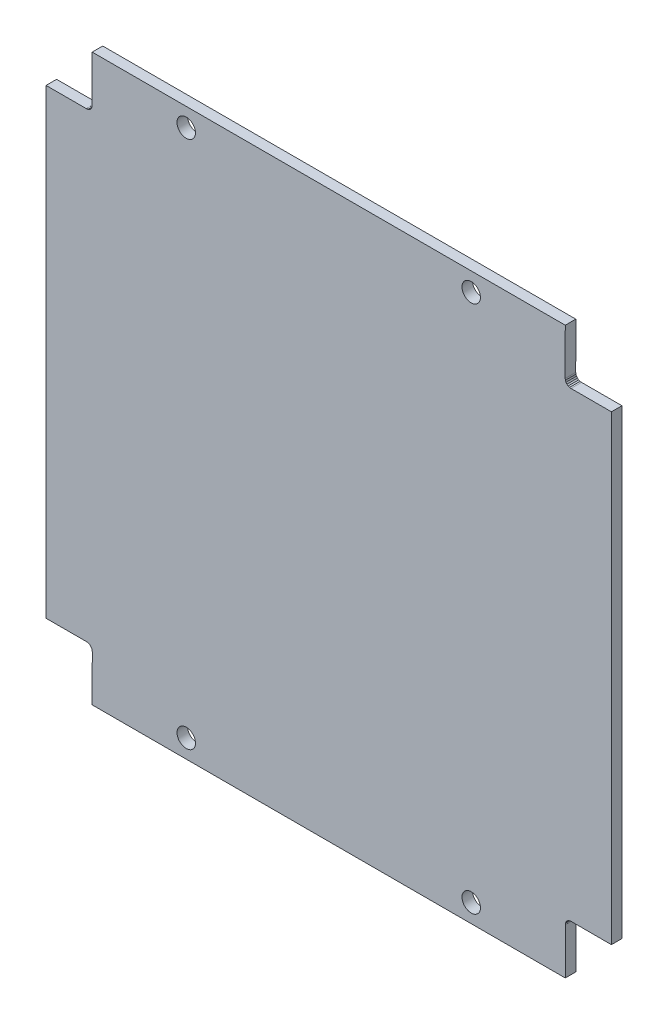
ISO-10303-21;
HEADER;
FILE_DESCRIPTION(('STEP AP214'),'2;1');
FILE_NAME('part.step','',(''),(''),'','','');
FILE_SCHEMA(('AUTOMOTIVE_DESIGN { 1 0 10303 214 1 1 1 1 }'));
ENDSEC;
DATA;
#1=APPLICATION_CONTEXT('core data for automotive mechanical design processes');
#2=APPLICATION_PROTOCOL_DEFINITION('international standard','automotive_design',2000,#1);
#3=PRODUCT_CONTEXT('',#1,'mechanical');
#4=PRODUCT('Part','Part','',(#3));
#5=PRODUCT_RELATED_PRODUCT_CATEGORY('part','',(#4));
#6=PRODUCT_DEFINITION_FORMATION('','',#4);
#7=PRODUCT_DEFINITION_CONTEXT('part definition',#1,'design');
#8=PRODUCT_DEFINITION('design','',#6,#7);
#9=PRODUCT_DEFINITION_SHAPE('','',#8);
#10=(LENGTH_UNIT() NAMED_UNIT(*) SI_UNIT(.MILLI.,.METRE.));
#11=(NAMED_UNIT(*) PLANE_ANGLE_UNIT() SI_UNIT($,.RADIAN.));
#12=(NAMED_UNIT(*) SI_UNIT($,.STERADIAN.) SOLID_ANGLE_UNIT());
#13=UNCERTAINTY_MEASURE_WITH_UNIT(LENGTH_MEASURE(1.E-05),#10,'distance_accuracy_value','');
#14=(GEOMETRIC_REPRESENTATION_CONTEXT(3) GLOBAL_UNCERTAINTY_ASSIGNED_CONTEXT((#13)) GLOBAL_UNIT_ASSIGNED_CONTEXT((#10,
#11,#12)) REPRESENTATION_CONTEXT('',''));
#15=CARTESIAN_POINT('',(0.,0.,0.));
#16=DIRECTION('',(0.,0.,1.));
#17=DIRECTION('',(1.,0.,0.));
#18=AXIS2_PLACEMENT_3D('',#15,#16,#17);
#19=CARTESIAN_POINT('',(7.71320784,8.71320584,0.));
#20=DIRECTION('',(-0.608763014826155,-0.793352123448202,0.));
#21=DIRECTION('',(0.793352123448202,-0.608763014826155,0.));
#22=AXIS2_PLACEMENT_3D('',#19,#20,#21);
#23=PLANE('',#22);
#24=DIRECTION('',(0.,0.,1.));
#25=VECTOR('',#24,1.);
#26=CARTESIAN_POINT('',(7.5043157,8.87349508,0.));
#27=LINE('',#26,#25);
#28=CARTESIAN_POINT('',(7.5043157,8.87349507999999,0.));
#29=VERTEX_POINT('',#28);
#30=CARTESIAN_POINT('',(7.5043157,8.87349507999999,1.82611268));
#31=VERTEX_POINT('',#30);
#32=EDGE_CURVE('E578',#29,#31,#27,.T.);
#33=ORIENTED_EDGE('',*,*,#32,.F.);
#34=DIRECTION('',(0.793352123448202,-0.608763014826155,0.));
#35=VECTOR('',#34,1.);
#36=CARTESIAN_POINT('',(7.71320784,8.71320584,0.));
#37=LINE('',#36,#35);
#38=CARTESIAN_POINT('',(7.71320784,8.71320584,0.));
#39=VERTEX_POINT('',#38);
#40=EDGE_CURVE('E293',#29,#39,#37,.T.);
#41=ORIENTED_EDGE('',*,*,#40,.T.);
#42=DIRECTION('',(0.,0.,1.));
#43=VECTOR('',#42,1.);
#44=CARTESIAN_POINT('',(7.71320784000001,8.71320584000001,0.));
#45=LINE('',#44,#43);
#46=CARTESIAN_POINT('',(7.71320784,8.71320584,1.82611268));
#47=VERTEX_POINT('',#46);
#48=EDGE_CURVE('E583',#47,#39,#45,.F.);
#49=ORIENTED_EDGE('',*,*,#48,.F.);
#50=DIRECTION('',(0.793352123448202,-0.608763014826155,0.));
#51=VECTOR('',#50,1.);
#52=CARTESIAN_POINT('',(7.71320784,8.71320584,1.82611268));
#53=LINE('',#52,#51);
#54=EDGE_CURVE('E314',#47,#31,#53,.F.);
#55=ORIENTED_EDGE('',*,*,#54,.T.);
#56=EDGE_LOOP('',(#33,#41,#49,#55));
#57=FACE_BOUND('',#56,.T.);
#58=ADVANCED_FACE('F17',(#57),#23,.T.);
#59=CARTESIAN_POINT('',(7.5043157,89.1265045,0.));
#60=DIRECTION('',(-0.608763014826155,0.793352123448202,0.));
#61=DIRECTION('',(-0.793352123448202,-0.608763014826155,0.));
#62=AXIS2_PLACEMENT_3D('',#59,#60,#61);
#63=PLANE('',#62);
#64=DIRECTION('',(0.,0.,1.));
#65=VECTOR('',#64,1.);
#66=CARTESIAN_POINT('',(7.71320784,89.28679374,0.));
#67=LINE('',#66,#65);
#68=CARTESIAN_POINT('',(7.71320784,89.28679374,0.));
#69=VERTEX_POINT('',#68);
#70=CARTESIAN_POINT('',(7.71320784,89.28679374,1.82611268));
#71=VERTEX_POINT('',#70);
#72=EDGE_CURVE('E287',#69,#71,#67,.T.);
#73=ORIENTED_EDGE('',*,*,#72,.F.);
#74=DIRECTION('',(-0.793352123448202,-0.608763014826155,0.));
#75=VECTOR('',#74,1.);
#76=CARTESIAN_POINT('',(7.5043157,89.1265045,0.));
#77=LINE('',#76,#75);
#78=CARTESIAN_POINT('',(7.50431569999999,89.1265045,0.));
#79=VERTEX_POINT('',#78);
#80=EDGE_CURVE('E277',#69,#79,#77,.T.);
#81=ORIENTED_EDGE('',*,*,#80,.T.);
#82=DIRECTION('',(0.,0.,1.));
#83=VECTOR('',#82,1.);
#84=CARTESIAN_POINT('',(7.50431569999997,89.1265045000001,0.));
#85=LINE('',#84,#83);
#86=CARTESIAN_POINT('',(7.50431569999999,89.1265045,1.82611268));
#87=VERTEX_POINT('',#86);
#88=EDGE_CURVE('E289',#87,#79,#85,.F.);
#89=ORIENTED_EDGE('',*,*,#88,.F.);
#90=DIRECTION('',(-0.793352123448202,-0.608763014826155,0.));
#91=VECTOR('',#90,1.);
#92=CARTESIAN_POINT('',(7.5043157,89.1265045,1.82611268));
#93=LINE('',#92,#91);
#94=EDGE_CURVE('E284',#87,#71,#93,.F.);
#95=ORIENTED_EDGE('',*,*,#94,.T.);
#96=EDGE_LOOP('',(#73,#81,#89,#95));
#97=FACE_BOUND('',#96,.T.);
#98=ADVANCED_FACE('F286',(#97),#63,.T.);
#99=CARTESIAN_POINT('',(7.71320784,89.28679374,0.));
#100=DIRECTION('',(-0.793355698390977,0.608758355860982,0.));
#101=DIRECTION('',(-0.608758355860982,-0.793355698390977,0.));
#102=AXIS2_PLACEMENT_3D('',#99,#100,#101);
#103=PLANE('',#102);
#104=DIRECTION('',(0.,0.,1.));
#105=VECTOR('',#104,1.);
#106=CARTESIAN_POINT('',(7.87349708,89.49568842,0.));
#107=LINE('',#106,#105);
#108=CARTESIAN_POINT('',(7.87349708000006,89.4956884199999,0.));
#109=VERTEX_POINT('',#108);
#110=CARTESIAN_POINT('',(7.87349708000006,89.4956884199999,1.82611268));
#111=VERTEX_POINT('',#110);
#112=EDGE_CURVE('E566',#109,#111,#107,.T.);
#113=ORIENTED_EDGE('',*,*,#112,.F.);
#114=DIRECTION('',(-0.608758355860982,-0.793355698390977,0.));
#115=VECTOR('',#114,1.);
#116=CARTESIAN_POINT('',(7.71320784,89.28679374,0.));
#117=LINE('',#116,#115);
#118=EDGE_CURVE('E300',#109,#69,#117,.T.);
#119=ORIENTED_EDGE('',*,*,#118,.T.);
#120=ORIENTED_EDGE('',*,*,#72,.T.);
#121=DIRECTION('',(-0.608758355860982,-0.793355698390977,0.));
#122=VECTOR('',#121,1.);
#123=CARTESIAN_POINT('',(7.71320784,89.28679374,1.82611268));
#124=LINE('',#123,#122);
#125=EDGE_CURVE('E298',#71,#111,#124,.F.);
#126=ORIENTED_EDGE('',*,*,#125,.T.);
#127=EDGE_LOOP('',(#113,#119,#120,#126));
#128=FACE_BOUND('',#127,.T.);
#129=ADVANCED_FACE('F297',(#128),#103,.T.);
#130=CARTESIAN_POINT('',(90.28679174,89.2867912,0.));
#131=DIRECTION('',(0.608758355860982,0.793355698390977,0.));
#132=DIRECTION('',(-0.793355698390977,0.608758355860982,0.));
#133=AXIS2_PLACEMENT_3D('',#130,#131,#132);
#134=PLANE('',#133);
#135=DIRECTION('',(0.,0.,1.));
#136=VECTOR('',#135,1.);
#137=CARTESIAN_POINT('',(90.49568642,89.12650196,0.));
#138=LINE('',#137,#136);
#139=CARTESIAN_POINT('',(90.4956864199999,89.1265019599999,0.));
#140=VERTEX_POINT('',#139);
#141=CARTESIAN_POINT('',(90.4956864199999,89.1265019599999,1.82611268));
#142=VERTEX_POINT('',#141);
#143=EDGE_CURVE('E552',#140,#142,#138,.T.);
#144=ORIENTED_EDGE('',*,*,#143,.F.);
#145=DIRECTION('',(-0.793355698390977,0.608758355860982,0.));
#146=VECTOR('',#145,1.);
#147=CARTESIAN_POINT('',(90.28679174,89.2867912,0.));
#148=LINE('',#147,#146);
#149=CARTESIAN_POINT('',(90.28679174,89.2867912,0.));
#150=VERTEX_POINT('',#149);
#151=EDGE_CURVE('E592',#140,#150,#148,.T.);
#152=ORIENTED_EDGE('',*,*,#151,.T.);
#153=DIRECTION('',(0.,0.,1.));
#154=VECTOR('',#153,1.);
#155=CARTESIAN_POINT('',(90.2867917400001,89.2867912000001,0.));
#156=LINE('',#155,#154);
#157=CARTESIAN_POINT('',(90.28679174,89.2867912,1.82611268));
#158=VERTEX_POINT('',#157);
#159=EDGE_CURVE('E557',#158,#150,#156,.F.);
#160=ORIENTED_EDGE('',*,*,#159,.F.);
#161=DIRECTION('',(-0.793355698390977,0.608758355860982,0.));
#162=VECTOR('',#161,1.);
#163=CARTESIAN_POINT('',(90.28679174,89.2867912,1.82611268));
#164=LINE('',#163,#162);
#165=EDGE_CURVE('E308',#158,#142,#164,.F.);
#166=ORIENTED_EDGE('',*,*,#165,.T.);
#167=EDGE_LOOP('',(#144,#152,#160,#166));
#168=FACE_BOUND('',#167,.T.);
#169=ADVANCED_FACE('F597',(#168),#134,.T.);
#170=CARTESIAN_POINT('',(90.28679174,8.71320838,0.));
#171=DIRECTION('',(0.793355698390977,-0.608758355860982,0.));
#172=DIRECTION('',(0.608758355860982,0.793355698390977,0.));
#173=AXIS2_PLACEMENT_3D('',#170,#171,#172);
#174=PLANE('',#173);
#175=DIRECTION('',(0.,0.,1.));
#176=VECTOR('',#175,1.);
#177=CARTESIAN_POINT('',(90.1265025,8.5043137,0.));
#178=LINE('',#177,#176);
#179=CARTESIAN_POINT('',(90.1265024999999,8.50431370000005,0.));
#180=VERTEX_POINT('',#179);
#181=CARTESIAN_POINT('',(90.1265024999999,8.50431370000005,1.82611268));
#182=VERTEX_POINT('',#181);
#183=EDGE_CURVE('E537',#180,#182,#178,.T.);
#184=ORIENTED_EDGE('',*,*,#183,.F.);
#185=DIRECTION('',(0.608758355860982,0.793355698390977,0.));
#186=VECTOR('',#185,1.);
#187=CARTESIAN_POINT('',(90.28679174,8.71320838,0.));
#188=LINE('',#187,#186);
#189=CARTESIAN_POINT('',(90.28679174,8.71320837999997,0.));
#190=VERTEX_POINT('',#189);
#191=EDGE_CURVE('E588',#180,#190,#188,.T.);
#192=ORIENTED_EDGE('',*,*,#191,.T.);
#193=DIRECTION('',(0.,0.,1.));
#194=VECTOR('',#193,1.);
#195=CARTESIAN_POINT('',(90.2867917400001,8.71320837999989,0.));
#196=LINE('',#195,#194);
#197=CARTESIAN_POINT('',(90.28679174,8.71320837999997,1.82611268));
#198=VERTEX_POINT('',#197);
#199=EDGE_CURVE('E542',#198,#190,#196,.F.);
#200=ORIENTED_EDGE('',*,*,#199,.F.);
#201=DIRECTION('',(0.608758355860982,0.793355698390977,0.));
#202=VECTOR('',#201,1.);
#203=CARTESIAN_POINT('',(90.28679174,8.71320838,1.82611268));
#204=LINE('',#203,#202);
#205=EDGE_CURVE('E590',#198,#182,#204,.F.);
#206=ORIENTED_EDGE('',*,*,#205,.T.);
#207=EDGE_LOOP('',(#184,#192,#200,#206));
#208=FACE_BOUND('',#207,.T.);
#209=ADVANCED_FACE('F691',(#208),#174,.T.);
#210=CARTESIAN_POINT('',(7.87349708,8.5043137,0.));
#211=DIRECTION('',(-0.793352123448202,-0.608763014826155,0.));
#212=DIRECTION('',(0.608763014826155,-0.793352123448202,0.));
#213=AXIS2_PLACEMENT_3D('',#210,#211,#212);
#214=PLANE('',#213);
#215=ORIENTED_EDGE('',*,*,#48,.T.);
#216=DIRECTION('',(0.608763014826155,-0.793352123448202,0.));
#217=VECTOR('',#216,1.);
#218=CARTESIAN_POINT('',(7.87349708,8.5043137,0.));
#219=LINE('',#218,#217);
#220=CARTESIAN_POINT('',(7.87349707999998,8.50431369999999,0.));
#221=VERTEX_POINT('',#220);
#222=EDGE_CURVE('E581',#39,#221,#219,.T.);
#223=ORIENTED_EDGE('',*,*,#222,.T.);
#224=DIRECTION('',(0.,0.,1.));
#225=VECTOR('',#224,1.);
#226=CARTESIAN_POINT('',(7.87349707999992,8.50431369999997,0.));
#227=LINE('',#226,#225);
#228=CARTESIAN_POINT('',(7.87349707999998,8.50431369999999,1.82611268));
#229=VERTEX_POINT('',#228);
#230=EDGE_CURVE('E527',#229,#221,#227,.F.);
#231=ORIENTED_EDGE('',*,*,#230,.F.);
#232=DIRECTION('',(0.608763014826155,-0.793352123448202,0.));
#233=VECTOR('',#232,1.);
#234=CARTESIAN_POINT('',(7.87349708,8.5043137,1.82611268));
#235=LINE('',#234,#233);
#236=EDGE_CURVE('E586',#229,#47,#235,.F.);
#237=ORIENTED_EDGE('',*,*,#236,.T.);
#238=EDGE_LOOP('',(#215,#223,#231,#237));
#239=FACE_BOUND('',#238,.T.);
#240=ADVANCED_FACE('F1056',(#239),#214,.T.);
#241=CARTESIAN_POINT('',(7.5043157,8.87349508,0.));
#242=DIRECTION('',(-0.382679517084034,-0.923881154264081,0.));
#243=DIRECTION('',(0.923881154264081,-0.382679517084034,0.));
#244=AXIS2_PLACEMENT_3D('',#241,#242,#243);
#245=PLANE('',#244);
#246=DIRECTION('',(0.,0.,1.));
#247=VECTOR('',#246,1.);
#248=CARTESIAN_POINT('',(7.26105228,8.97425688,0.));
#249=LINE('',#248,#247);
#250=CARTESIAN_POINT('',(7.26105228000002,8.97425688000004,0.));
#251=VERTEX_POINT('',#250);
#252=CARTESIAN_POINT('',(7.26105228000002,8.97425688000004,1.82611268));
#253=VERTEX_POINT('',#252);
#254=EDGE_CURVE('E522',#251,#253,#249,.T.);
#255=ORIENTED_EDGE('',*,*,#254,.F.);
#256=DIRECTION('',(0.923881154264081,-0.382679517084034,0.));
#257=VECTOR('',#256,1.);
#258=CARTESIAN_POINT('',(7.5043157,8.87349508,0.));
#259=LINE('',#258,#257);
#260=EDGE_CURVE('E573',#251,#29,#259,.T.);
#261=ORIENTED_EDGE('',*,*,#260,.T.);
#262=ORIENTED_EDGE('',*,*,#32,.T.);
#263=DIRECTION('',(0.923881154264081,-0.382679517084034,0.));
#264=VECTOR('',#263,1.);
#265=CARTESIAN_POINT('',(7.5043157,8.87349508,1.82611268));
#266=LINE('',#265,#264);
#267=EDGE_CURVE('E576',#31,#253,#266,.F.);
#268=ORIENTED_EDGE('',*,*,#267,.T.);
#269=EDGE_LOOP('',(#255,#261,#262,#268));
#270=FACE_BOUND('',#269,.T.);
#271=ADVANCED_FACE('F1047',(#270),#245,.T.);
#272=CARTESIAN_POINT('',(7.26105228,89.0257427,0.));
#273=DIRECTION('',(-0.382679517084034,0.923881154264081,0.));
#274=DIRECTION('',(-0.923881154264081,-0.382679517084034,0.));
#275=AXIS2_PLACEMENT_3D('',#272,#273,#274);
#276=PLANE('',#275);
#277=ORIENTED_EDGE('',*,*,#88,.T.);
#278=DIRECTION('',(-0.923881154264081,-0.382679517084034,0.));
#279=VECTOR('',#278,1.);
#280=CARTESIAN_POINT('',(7.26105228,89.0257427,0.));
#281=LINE('',#280,#279);
#282=CARTESIAN_POINT('',(7.26105228,89.0257427,0.));
#283=VERTEX_POINT('',#282);
#284=EDGE_CURVE('E568',#79,#283,#281,.T.);
#285=ORIENTED_EDGE('',*,*,#284,.T.);
#286=DIRECTION('',(0.,0.,1.));
#287=VECTOR('',#286,1.);
#288=CARTESIAN_POINT('',(7.26105227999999,89.0257427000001,0.));
#289=LINE('',#288,#287);
#290=CARTESIAN_POINT('',(7.26105228,89.0257427,1.82611268));
#291=VERTEX_POINT('',#290);
#292=EDGE_CURVE('E512',#291,#283,#289,.F.);
#293=ORIENTED_EDGE('',*,*,#292,.F.);
#294=DIRECTION('',(-0.923881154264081,-0.382679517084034,0.));
#295=VECTOR('',#294,1.);
#296=CARTESIAN_POINT('',(7.26105228,89.0257427,1.82611268));
#297=LINE('',#296,#295);
#298=EDGE_CURVE('E571',#291,#87,#297,.F.);
#299=ORIENTED_EDGE('',*,*,#298,.T.);
#300=EDGE_LOOP('',(#277,#285,#293,#299));
#301=FACE_BOUND('',#300,.T.);
#302=ADVANCED_FACE('F1038',(#301),#276,.T.);
#303=CARTESIAN_POINT('',(7.87349708,89.49568842,0.));
#304=DIRECTION('',(-0.923879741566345,0.382682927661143,0.));
#305=DIRECTION('',(-0.382682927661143,-0.923879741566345,0.));
#306=AXIS2_PLACEMENT_3D('',#303,#304,#305);
#307=PLANE('',#306);
#308=DIRECTION('',(0.,0.,1.));
#309=VECTOR('',#308,1.);
#310=CARTESIAN_POINT('',(7.97425888,89.7389493,0.));
#311=LINE('',#310,#309);
#312=CARTESIAN_POINT('',(7.97425888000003,89.7389493,0.));
#313=VERTEX_POINT('',#312);
#314=CARTESIAN_POINT('',(7.97425888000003,89.7389493,1.82611268));
#315=VERTEX_POINT('',#314);
#316=EDGE_CURVE('E507',#313,#315,#311,.T.);
#317=ORIENTED_EDGE('',*,*,#316,.F.);
#318=DIRECTION('',(-0.382682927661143,-0.923879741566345,0.));
#319=VECTOR('',#318,1.);
#320=CARTESIAN_POINT('',(7.87349708,89.49568842,0.));
#321=LINE('',#320,#319);
#322=EDGE_CURVE('E562',#313,#109,#321,.T.);
#323=ORIENTED_EDGE('',*,*,#322,.T.);
#324=ORIENTED_EDGE('',*,*,#112,.T.);
#325=DIRECTION('',(-0.382682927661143,-0.923879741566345,0.));
#326=VECTOR('',#325,1.);
#327=CARTESIAN_POINT('',(7.87349708,89.49568842,1.82611268));
#328=LINE('',#327,#326);
#329=EDGE_CURVE('E306',#111,#315,#328,.F.);
#330=ORIENTED_EDGE('',*,*,#329,.T.);
#331=EDGE_LOOP('',(#317,#323,#324,#330));
#332=FACE_BOUND('',#331,.T.);
#333=ADVANCED_FACE('F1029',(#332),#307,.T.);
#334=CARTESIAN_POINT('',(90.1265025,89.49568588,0.));
#335=DIRECTION('',(0.793355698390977,0.608758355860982,0.));
#336=DIRECTION('',(-0.608758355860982,0.793355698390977,0.));
#337=AXIS2_PLACEMENT_3D('',#334,#335,#336);
#338=PLANE('',#337);
#339=ORIENTED_EDGE('',*,*,#159,.T.);
#340=DIRECTION('',(-0.608758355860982,0.793355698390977,0.));
#341=VECTOR('',#340,1.);
#342=CARTESIAN_POINT('',(90.1265025,89.49568588,0.));
#343=LINE('',#342,#341);
#344=CARTESIAN_POINT('',(90.1265025,89.49568588,0.));
#345=VERTEX_POINT('',#344);
#346=EDGE_CURVE('E555',#150,#345,#343,.T.);
#347=ORIENTED_EDGE('',*,*,#346,.T.);
#348=DIRECTION('',(0.,0.,1.));
#349=VECTOR('',#348,1.);
#350=CARTESIAN_POINT('',(90.1265025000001,89.49568588,0.));
#351=LINE('',#350,#349);
#352=CARTESIAN_POINT('',(90.1265025,89.49568588,1.82611268));
#353=VERTEX_POINT('',#352);
#354=EDGE_CURVE('E497',#353,#345,#351,.F.);
#355=ORIENTED_EDGE('',*,*,#354,.F.);
#356=DIRECTION('',(-0.608758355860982,0.793355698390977,0.));
#357=VECTOR('',#356,1.);
#358=CARTESIAN_POINT('',(90.1265025,89.49568588,1.82611268));
#359=LINE('',#358,#357);
#360=EDGE_CURVE('E560',#353,#158,#359,.F.);
#361=ORIENTED_EDGE('',*,*,#360,.T.);
#362=EDGE_LOOP('',(#339,#347,#355,#361));
#363=FACE_BOUND('',#362,.T.);
#364=ADVANCED_FACE('F1021',(#363),#338,.T.);
#365=CARTESIAN_POINT('',(90.49568642,89.12650196,0.));
#366=DIRECTION('',(0.382682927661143,0.923879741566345,0.));
#367=DIRECTION('',(-0.923879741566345,0.382682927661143,0.));
#368=AXIS2_PLACEMENT_3D('',#365,#366,#367);
#369=PLANE('',#368);
#370=DIRECTION('',(0.,0.,1.));
#371=VECTOR('',#370,1.);
#372=CARTESIAN_POINT('',(90.7389473,89.02574016,0.));
#373=LINE('',#372,#371);
#374=CARTESIAN_POINT('',(90.7389473,89.02574016,0.));
#375=VERTEX_POINT('',#374);
#376=CARTESIAN_POINT('',(90.7389473,89.02574016,1.82611268));
#377=VERTEX_POINT('',#376);
#378=EDGE_CURVE('E492',#375,#377,#373,.T.);
#379=ORIENTED_EDGE('',*,*,#378,.F.);
#380=DIRECTION('',(-0.923879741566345,0.382682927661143,0.));
#381=VECTOR('',#380,1.);
#382=CARTESIAN_POINT('',(90.49568642,89.12650196,0.));
#383=LINE('',#382,#381);
#384=EDGE_CURVE('E547',#375,#140,#383,.T.);
#385=ORIENTED_EDGE('',*,*,#384,.T.);
#386=ORIENTED_EDGE('',*,*,#143,.T.);
#387=DIRECTION('',(-0.923879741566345,0.382682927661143,0.));
#388=VECTOR('',#387,1.);
#389=CARTESIAN_POINT('',(90.49568642,89.12650196,1.82611268));
#390=LINE('',#389,#388);
#391=EDGE_CURVE('E550',#142,#377,#390,.F.);
#392=ORIENTED_EDGE('',*,*,#391,.T.);
#393=EDGE_LOOP('',(#379,#385,#386,#392));
#394=FACE_BOUND('',#393,.T.);
#395=ADVANCED_FACE('F602',(#394),#369,.T.);
#396=CARTESIAN_POINT('',(90.49568642,8.87349762,0.));
#397=DIRECTION('',(0.608758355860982,-0.793355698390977,0.));
#398=DIRECTION('',(0.793355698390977,0.608758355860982,0.));
#399=AXIS2_PLACEMENT_3D('',#396,#397,#398);
#400=PLANE('',#399);
#401=ORIENTED_EDGE('',*,*,#199,.T.);
#402=DIRECTION('',(0.793355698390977,0.608758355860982,0.));
#403=VECTOR('',#402,1.);
#404=CARTESIAN_POINT('',(90.49568642,8.87349762,0.));
#405=LINE('',#404,#403);
#406=CARTESIAN_POINT('',(90.49568642,8.87349761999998,0.));
#407=VERTEX_POINT('',#406);
#408=EDGE_CURVE('E540',#190,#407,#405,.T.);
#409=ORIENTED_EDGE('',*,*,#408,.T.);
#410=DIRECTION('',(0.,0.,1.));
#411=VECTOR('',#410,1.);
#412=CARTESIAN_POINT('',(90.49568642,8.87349761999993,0.));
#413=LINE('',#412,#411);
#414=CARTESIAN_POINT('',(90.49568642,8.87349761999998,1.82611268));
#415=VERTEX_POINT('',#414);
#416=EDGE_CURVE('E482',#415,#407,#413,.F.);
#417=ORIENTED_EDGE('',*,*,#416,.F.);
#418=DIRECTION('',(0.793355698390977,0.608758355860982,0.));
#419=VECTOR('',#418,1.);
#420=CARTESIAN_POINT('',(90.49568642,8.87349762,1.82611268));
#421=LINE('',#420,#419);
#422=EDGE_CURVE('E545',#415,#198,#421,.F.);
#423=ORIENTED_EDGE('',*,*,#422,.T.);
#424=EDGE_LOOP('',(#401,#409,#417,#423));
#425=FACE_BOUND('',#424,.T.);
#426=ADVANCED_FACE('F694',(#425),#400,.T.);
#427=CARTESIAN_POINT('',(90.1265025,8.5043137,0.));
#428=DIRECTION('',(0.923879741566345,-0.382682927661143,0.));
#429=DIRECTION('',(0.382682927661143,0.923879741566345,0.));
#430=AXIS2_PLACEMENT_3D('',#427,#428,#429);
#431=PLANE('',#430);
#432=DIRECTION('',(0.,0.,1.));
#433=VECTOR('',#432,1.);
#434=CARTESIAN_POINT('',(90.0257407,8.26105282,0.));
#435=LINE('',#434,#433);
#436=CARTESIAN_POINT('',(90.0257407,8.26105282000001,0.));
#437=VERTEX_POINT('',#436);
#438=CARTESIAN_POINT('',(90.0257407,8.26105282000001,1.82611268));
#439=VERTEX_POINT('',#438);
#440=EDGE_CURVE('E477',#437,#439,#435,.T.);
#441=ORIENTED_EDGE('',*,*,#440,.F.);
#442=DIRECTION('',(0.382682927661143,0.923879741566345,0.));
#443=VECTOR('',#442,1.);
#444=CARTESIAN_POINT('',(90.1265025,8.5043137,0.));
#445=LINE('',#444,#443);
#446=EDGE_CURVE('E532',#437,#180,#445,.T.);
#447=ORIENTED_EDGE('',*,*,#446,.T.);
#448=ORIENTED_EDGE('',*,*,#183,.T.);
#449=DIRECTION('',(0.382682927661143,0.923879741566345,0.));
#450=VECTOR('',#449,1.);
#451=CARTESIAN_POINT('',(90.1265025,8.5043137,1.82611268));
#452=LINE('',#451,#450);
#453=EDGE_CURVE('E535',#182,#439,#452,.F.);
#454=ORIENTED_EDGE('',*,*,#453,.T.);
#455=EDGE_LOOP('',(#441,#447,#448,#454));
#456=FACE_BOUND('',#455,.T.);
#457=ADVANCED_FACE('F683',(#456),#431,.T.);
#458=CARTESIAN_POINT('',(7.97425888,8.26105028,0.));
#459=DIRECTION('',(-0.923881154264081,-0.382679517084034,0.));
#460=DIRECTION('',(0.382679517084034,-0.923881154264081,0.));
#461=AXIS2_PLACEMENT_3D('',#458,#459,#460);
#462=PLANE('',#461);
#463=ORIENTED_EDGE('',*,*,#230,.T.);
#464=DIRECTION('',(0.382679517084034,-0.923881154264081,0.));
#465=VECTOR('',#464,1.);
#466=CARTESIAN_POINT('',(7.97425888,8.26105028,0.));
#467=LINE('',#466,#465);
#468=CARTESIAN_POINT('',(7.97425887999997,8.26105028,0.));
#469=VERTEX_POINT('',#468);
#470=EDGE_CURVE('E525',#221,#469,#467,.T.);
#471=ORIENTED_EDGE('',*,*,#470,.T.);
#472=DIRECTION('',(0.,0.,1.));
#473=VECTOR('',#472,1.);
#474=CARTESIAN_POINT('',(7.9742588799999,8.26105027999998,0.));
#475=LINE('',#474,#473);
#476=CARTESIAN_POINT('',(7.97425887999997,8.26105028,1.82611268));
#477=VERTEX_POINT('',#476);
#478=EDGE_CURVE('E467',#477,#469,#475,.F.);
#479=ORIENTED_EDGE('',*,*,#478,.F.);
#480=DIRECTION('',(0.382679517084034,-0.923881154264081,0.));
#481=VECTOR('',#480,1.);
#482=CARTESIAN_POINT('',(7.97425888,8.26105028,1.82611268));
#483=LINE('',#482,#481);
#484=EDGE_CURVE('E530',#477,#229,#483,.F.);
#485=ORIENTED_EDGE('',*,*,#484,.T.);
#486=EDGE_LOOP('',(#463,#471,#479,#485));
#487=FACE_BOUND('',#486,.T.);
#488=ADVANCED_FACE('F990',(#487),#462,.T.);
#489=CARTESIAN_POINT('',(7.26105228,8.97425688,0.));
#490=DIRECTION('',(-0.130528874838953,-0.99144450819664,0.));
#491=DIRECTION('',(0.99144450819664,-0.130528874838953,0.));
#492=AXIS2_PLACEMENT_3D('',#489,#490,#491);
#493=PLANE('',#492);
#494=DIRECTION('',(0.,0.,-1.));
#495=VECTOR('',#494,1.);
#496=CARTESIAN_POINT('',(7.00000124,9.00862562,0.));
#497=LINE('',#496,#495);
#498=CARTESIAN_POINT('',(7.00000124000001,9.00862562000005,0.));
#499=VERTEX_POINT('',#498);
#500=CARTESIAN_POINT('',(7.00000124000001,9.00862562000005,1.82611268));
#501=VERTEX_POINT('',#500);
#502=EDGE_CURVE('E464',#499,#501,#497,.F.);
#503=ORIENTED_EDGE('',*,*,#502,.F.);
#504=DIRECTION('',(0.99144450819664,-0.130528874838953,0.));
#505=VECTOR('',#504,1.);
#506=CARTESIAN_POINT('',(7.26105228,8.97425688,0.));
#507=LINE('',#506,#505);
#508=EDGE_CURVE('E517',#499,#251,#507,.T.);
#509=ORIENTED_EDGE('',*,*,#508,.T.);
#510=ORIENTED_EDGE('',*,*,#254,.T.);
#511=DIRECTION('',(0.99144450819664,-0.130528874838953,0.));
#512=VECTOR('',#511,1.);
#513=CARTESIAN_POINT('',(7.26105228,8.97425688,1.82611268));
#514=LINE('',#513,#512);
#515=EDGE_CURVE('E520',#253,#501,#514,.F.);
#516=ORIENTED_EDGE('',*,*,#515,.T.);
#517=EDGE_LOOP('',(#503,#509,#510,#516));
#518=FACE_BOUND('',#517,.T.);
#519=ADVANCED_FACE('F981',(#518),#493,.T.);
#520=CARTESIAN_POINT('',(7.00000124,88.99137396,0.));
#521=DIRECTION('',(-0.130528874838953,0.99144450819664,0.));
#522=DIRECTION('',(-0.99144450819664,-0.130528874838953,0.));
#523=AXIS2_PLACEMENT_3D('',#520,#521,#522);
#524=PLANE('',#523);
#525=ORIENTED_EDGE('',*,*,#292,.T.);
#526=DIRECTION('',(-0.99144450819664,-0.130528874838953,0.));
#527=VECTOR('',#526,1.);
#528=CARTESIAN_POINT('',(7.00000124,88.99137396,0.));
#529=LINE('',#528,#527);
#530=CARTESIAN_POINT('',(7.00000124,88.99137396,0.));
#531=VERTEX_POINT('',#530);
#532=EDGE_CURVE('E510',#283,#531,#529,.T.);
#533=ORIENTED_EDGE('',*,*,#532,.T.);
#534=DIRECTION('',(0.,0.,-1.));
#535=VECTOR('',#534,1.);
#536=CARTESIAN_POINT('',(7.00000124,88.99137396,0.));
#537=LINE('',#536,#535);
#538=CARTESIAN_POINT('',(7.00000124,88.99137396,1.82611268));
#539=VERTEX_POINT('',#538);
#540=EDGE_CURVE('E457',#539,#531,#537,.T.);
#541=ORIENTED_EDGE('',*,*,#540,.F.);
#542=DIRECTION('',(-0.99144450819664,-0.130528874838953,0.));
#543=VECTOR('',#542,1.);
#544=CARTESIAN_POINT('',(7.00000124,88.99137396,1.82611268));
#545=LINE('',#544,#543);
#546=EDGE_CURVE('E515',#539,#291,#545,.F.);
#547=ORIENTED_EDGE('',*,*,#546,.T.);
#548=EDGE_LOOP('',(#525,#533,#541,#547));
#549=FACE_BOUND('',#548,.T.);
#550=ADVANCED_FACE('F972',(#549),#524,.T.);
#551=CARTESIAN_POINT('',(7.97425888,89.7389493,0.));
#552=DIRECTION('',(-0.99144450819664,0.130528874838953,0.));
#553=DIRECTION('',(-0.130528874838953,-0.99144450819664,0.));
#554=AXIS2_PLACEMENT_3D('',#551,#552,#553);
#555=PLANE('',#554);
#556=DIRECTION('',(0.,0.,-1.));
#557=VECTOR('',#556,1.);
#558=CARTESIAN_POINT('',(8.00862762,90.00000034,0.));
#559=LINE('',#558,#557);
#560=CARTESIAN_POINT('',(8.00862762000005,90.00000034,0.));
#561=VERTEX_POINT('',#560);
#562=CARTESIAN_POINT('',(8.00862762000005,90.00000034,1.82611268));
#563=VERTEX_POINT('',#562);
#564=EDGE_CURVE('E454',#561,#563,#559,.F.);
#565=ORIENTED_EDGE('',*,*,#564,.F.);
#566=DIRECTION('',(-0.130528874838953,-0.99144450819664,0.));
#567=VECTOR('',#566,1.);
#568=CARTESIAN_POINT('',(7.97425888,89.7389493,0.));
#569=LINE('',#568,#567);
#570=EDGE_CURVE('E502',#561,#313,#569,.T.);
#571=ORIENTED_EDGE('',*,*,#570,.T.);
#572=ORIENTED_EDGE('',*,*,#316,.T.);
#573=DIRECTION('',(-0.130528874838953,-0.99144450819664,0.));
#574=VECTOR('',#573,1.);
#575=CARTESIAN_POINT('',(7.97425888,89.7389493,1.82611268));
#576=LINE('',#575,#574);
#577=EDGE_CURVE('E505',#315,#563,#576,.F.);
#578=ORIENTED_EDGE('',*,*,#577,.T.);
#579=EDGE_LOOP('',(#565,#571,#572,#578));
#580=FACE_BOUND('',#579,.T.);
#581=ADVANCED_FACE('F963',(#580),#555,.T.);
#582=CARTESIAN_POINT('',(90.0257407,89.73894676,0.));
#583=DIRECTION('',(0.923879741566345,0.382682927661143,0.));
#584=DIRECTION('',(-0.382682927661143,0.923879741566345,0.));
#585=AXIS2_PLACEMENT_3D('',#582,#583,#584);
#586=PLANE('',#585);
#587=ORIENTED_EDGE('',*,*,#354,.T.);
#588=DIRECTION('',(-0.382682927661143,0.923879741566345,0.));
#589=VECTOR('',#588,1.);
#590=CARTESIAN_POINT('',(90.0257407,89.73894676,0.));
#591=LINE('',#590,#589);
#592=CARTESIAN_POINT('',(90.0257407,89.73894676,0.));
#593=VERTEX_POINT('',#592);
#594=EDGE_CURVE('E495',#345,#593,#591,.T.);
#595=ORIENTED_EDGE('',*,*,#594,.T.);
#596=DIRECTION('',(0.,0.,1.));
#597=VECTOR('',#596,1.);
#598=CARTESIAN_POINT('',(90.0257406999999,89.73894676,0.));
#599=LINE('',#598,#597);
#600=CARTESIAN_POINT('',(90.0257407,89.73894676,1.82611268));
#601=VERTEX_POINT('',#600);
#602=EDGE_CURVE('E447',#601,#593,#599,.F.);
#603=ORIENTED_EDGE('',*,*,#602,.F.);
#604=DIRECTION('',(-0.382682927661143,0.923879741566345,0.));
#605=VECTOR('',#604,1.);
#606=CARTESIAN_POINT('',(90.0257407,89.73894676,1.82611268));
#607=LINE('',#606,#605);
#608=EDGE_CURVE('E500',#601,#353,#607,.F.);
#609=ORIENTED_EDGE('',*,*,#608,.T.);
#610=EDGE_LOOP('',(#587,#595,#603,#609));
#611=FACE_BOUND('',#610,.T.);
#612=ADVANCED_FACE('F955',(#611),#586,.T.);
#613=CARTESIAN_POINT('',(90.7389473,89.02574016,0.));
#614=DIRECTION('',(0.130527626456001,0.99144467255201,0.));
#615=DIRECTION('',(-0.99144467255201,0.130527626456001,0.));
#616=AXIS2_PLACEMENT_3D('',#613,#614,#615);
#617=PLANE('',#616);
#618=DIRECTION('',(0.,0.,1.));
#619=VECTOR('',#618,1.);
#620=CARTESIAN_POINT('',(91.00000088,88.99137142,0.));
#621=LINE('',#620,#619);
#622=CARTESIAN_POINT('',(91.00000088,88.99137142,0.));
#623=VERTEX_POINT('',#622);
#624=CARTESIAN_POINT('',(91.00000088,88.99137142,1.82611268));
#625=VERTEX_POINT('',#624);
#626=EDGE_CURVE('E444',#623,#625,#621,.T.);
#627=ORIENTED_EDGE('',*,*,#626,.F.);
#628=DIRECTION('',(-0.99144467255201,0.130527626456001,0.));
#629=VECTOR('',#628,1.);
#630=CARTESIAN_POINT('',(90.7389473,89.02574016,0.));
#631=LINE('',#630,#629);
#632=EDGE_CURVE('E487',#623,#375,#631,.T.);
#633=ORIENTED_EDGE('',*,*,#632,.T.);
#634=ORIENTED_EDGE('',*,*,#378,.T.);
#635=DIRECTION('',(-0.99144467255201,0.130527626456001,0.));
#636=VECTOR('',#635,1.);
#637=CARTESIAN_POINT('',(90.7389473,89.02574016,1.82611268));
#638=LINE('',#637,#636);
#639=EDGE_CURVE('E490',#377,#625,#638,.F.);
#640=ORIENTED_EDGE('',*,*,#639,.T.);
#641=EDGE_LOOP('',(#627,#633,#634,#640));
#642=FACE_BOUND('',#641,.T.);
#643=ADVANCED_FACE('F608',(#642),#617,.T.);
#644=CARTESIAN_POINT('',(90.7389473,8.97425942,0.));
#645=DIRECTION('',(0.382682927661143,-0.923879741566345,0.));
#646=DIRECTION('',(0.923879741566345,0.382682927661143,0.));
#647=AXIS2_PLACEMENT_3D('',#644,#645,#646);
#648=PLANE('',#647);
#649=ORIENTED_EDGE('',*,*,#416,.T.);
#650=DIRECTION('',(0.923879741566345,0.382682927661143,0.));
#651=VECTOR('',#650,1.);
#652=CARTESIAN_POINT('',(90.7389473,8.97425942,0.));
#653=LINE('',#652,#651);
#654=CARTESIAN_POINT('',(90.7389473,8.97425942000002,0.));
#655=VERTEX_POINT('',#654);
#656=EDGE_CURVE('E480',#407,#655,#653,.T.);
#657=ORIENTED_EDGE('',*,*,#656,.T.);
#658=DIRECTION('',(0.,0.,1.));
#659=VECTOR('',#658,1.);
#660=CARTESIAN_POINT('',(90.7389473,8.97425942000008,0.));
#661=LINE('',#660,#659);
#662=CARTESIAN_POINT('',(90.7389473,8.97425942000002,1.82611268));
#663=VERTEX_POINT('',#662);
#664=EDGE_CURVE('E437',#663,#655,#661,.F.);
#665=ORIENTED_EDGE('',*,*,#664,.F.);
#666=DIRECTION('',(0.923879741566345,0.382682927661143,0.));
#667=VECTOR('',#666,1.);
#668=CARTESIAN_POINT('',(90.7389473,8.97425942,1.82611268));
#669=LINE('',#668,#667);
#670=EDGE_CURVE('E485',#663,#415,#669,.F.);
#671=ORIENTED_EDGE('',*,*,#670,.T.);
#672=EDGE_LOOP('',(#649,#657,#665,#671));
#673=FACE_BOUND('',#672,.T.);
#674=ADVANCED_FACE('F700',(#673),#648,.T.);
#675=CARTESIAN_POINT('',(90.0257407,8.26105282,0.));
#676=DIRECTION('',(0.99144467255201,-0.130527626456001,0.));
#677=DIRECTION('',(0.130527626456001,0.99144467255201,0.));
#678=AXIS2_PLACEMENT_3D('',#675,#676,#677);
#679=PLANE('',#678);
#680=DIRECTION('',(0.,0.,1.));
#681=VECTOR('',#680,1.);
#682=CARTESIAN_POINT('',(89.99137196,7.99999924,0.));
#683=LINE('',#682,#681);
#684=CARTESIAN_POINT('',(89.99137196,7.99999923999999,0.));
#685=VERTEX_POINT('',#684);
#686=CARTESIAN_POINT('',(89.99137196,7.99999923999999,1.82611268));
#687=VERTEX_POINT('',#686);
#688=EDGE_CURVE('E434',#685,#687,#683,.T.);
#689=ORIENTED_EDGE('',*,*,#688,.F.);
#690=DIRECTION('',(0.130527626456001,0.99144467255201,0.));
#691=VECTOR('',#690,1.);
#692=CARTESIAN_POINT('',(90.0257407,8.26105282,0.));
#693=LINE('',#692,#691);
#694=EDGE_CURVE('E472',#685,#437,#693,.T.);
#695=ORIENTED_EDGE('',*,*,#694,.T.);
#696=ORIENTED_EDGE('',*,*,#440,.T.);
#697=DIRECTION('',(0.130527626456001,0.99144467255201,0.));
#698=VECTOR('',#697,1.);
#699=CARTESIAN_POINT('',(90.0257407,8.26105282,1.82611268));
#700=LINE('',#699,#698);
#701=EDGE_CURVE('E475',#439,#687,#700,.F.);
#702=ORIENTED_EDGE('',*,*,#701,.T.);
#703=EDGE_LOOP('',(#689,#695,#696,#702));
#704=FACE_BOUND('',#703,.T.);
#705=ADVANCED_FACE('F680',(#704),#679,.T.);
#706=CARTESIAN_POINT('',(8.00862762,7.99999924,0.));
#707=DIRECTION('',(-0.99144450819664,-0.130528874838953,0.));
#708=DIRECTION('',(0.130528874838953,-0.99144450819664,0.));
#709=AXIS2_PLACEMENT_3D('',#706,#707,#708);
#710=PLANE('',#709);
#711=ORIENTED_EDGE('',*,*,#478,.T.);
#712=DIRECTION('',(-0.130528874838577,0.991444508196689,0.));
#713=VECTOR('',#712,1.);
#714=CARTESIAN_POINT('',(8.00862762,7.99999924,0.));
#715=LINE('',#714,#713);
#716=CARTESIAN_POINT('',(8.00862762,7.99999923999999,0.));
#717=VERTEX_POINT('',#716);
#718=EDGE_CURVE('E429',#717,#469,#715,.T.);
#719=ORIENTED_EDGE('',*,*,#718,.F.);
#720=DIRECTION('',(0.,0.,1.));
#721=VECTOR('',#720,1.);
#722=CARTESIAN_POINT('',(8.00862761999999,7.99999924,0.));
#723=LINE('',#722,#721);
#724=CARTESIAN_POINT('',(8.00862762,7.99999923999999,1.82611268));
#725=VERTEX_POINT('',#724);
#726=EDGE_CURVE('E410',#725,#717,#723,.F.);
#727=ORIENTED_EDGE('',*,*,#726,.F.);
#728=DIRECTION('',(0.130528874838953,-0.99144450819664,0.));
#729=VECTOR('',#728,1.);
#730=CARTESIAN_POINT('',(8.00862762,7.99999924,1.82611268));
#731=LINE('',#730,#729);
#732=EDGE_CURVE('E470',#725,#477,#731,.F.);
#733=ORIENTED_EDGE('',*,*,#732,.T.);
#734=EDGE_LOOP('',(#711,#719,#727,#733));
#735=FACE_BOUND('',#734,.T.);
#736=ADVANCED_FACE('F664',(#735),#710,.T.);
#737=CARTESIAN_POINT('',(7.00000124,9.00862562,0.));
#738=DIRECTION('',(1.,0.,0.));
#739=DIRECTION('',(0.,0.,-1.));
#740=AXIS2_PLACEMENT_3D('',#737,#738,#739);
#741=PLANE('',#740);
#742=DIRECTION('',(0.,0.,-1.));
#743=VECTOR('',#742,1.);
#744=CARTESIAN_POINT('',(7.00000124,8.99999978,0.));
#745=LINE('',#744,#743);
#746=CARTESIAN_POINT('',(7.00000124,8.99999851,0.));
#747=VERTEX_POINT('',#746);
#748=CARTESIAN_POINT('',(7.00000124,8.99999851,1.82611268));
#749=VERTEX_POINT('',#748);
#750=EDGE_CURVE('E405',#747,#749,#745,.F.);
#751=ORIENTED_EDGE('',*,*,#750,.F.);
#752=DIRECTION('',(0.,1.,0.));
#753=VECTOR('',#752,1.);
#754=CARTESIAN_POINT('',(7.00000124,0.,0.));
#755=LINE('',#754,#753);
#756=EDGE_CURVE('E427',#499,#747,#755,.F.);
#757=ORIENTED_EDGE('',*,*,#756,.F.);
#758=ORIENTED_EDGE('',*,*,#502,.T.);
#759=DIRECTION('',(0.,1.,0.));
#760=VECTOR('',#759,1.);
#761=CARTESIAN_POINT('',(7.00000124,9.00862562,1.82611268));
#762=LINE('',#761,#760);
#763=EDGE_CURVE('E462',#501,#749,#762,.F.);
#764=ORIENTED_EDGE('',*,*,#763,.T.);
#765=EDGE_LOOP('',(#751,#757,#758,#764));
#766=FACE_BOUND('',#765,.T.);
#767=ADVANCED_FACE('F917',(#766),#741,.T.);
#768=CARTESIAN_POINT('',(7.00000124,88.9999998,0.));
#769=DIRECTION('',(1.,0.,0.));
#770=DIRECTION('',(0.,0.,-1.));
#771=AXIS2_PLACEMENT_3D('',#768,#769,#770);
#772=PLANE('',#771);
#773=ORIENTED_EDGE('',*,*,#540,.T.);
#774=DIRECTION('',(0.,1.,0.));
#775=VECTOR('',#774,1.);
#776=CARTESIAN_POINT('',(7.00000124,0.,0.));
#777=LINE('',#776,#775);
#778=CARTESIAN_POINT('',(7.00000124,88.9999998,0.));
#779=VERTEX_POINT('',#778);
#780=EDGE_CURVE('E424',#779,#531,#777,.F.);
#781=ORIENTED_EDGE('',*,*,#780,.F.);
#782=DIRECTION('',(0.,0.,1.));
#783=VECTOR('',#782,1.);
#784=CARTESIAN_POINT('',(7.00000124,88.9999998,0.));
#785=LINE('',#784,#783);
#786=CARTESIAN_POINT('',(7.00000124,88.9999998,1.82611268));
#787=VERTEX_POINT('',#786);
#788=EDGE_CURVE('E393',#787,#779,#785,.F.);
#789=ORIENTED_EDGE('',*,*,#788,.F.);
#790=DIRECTION('',(0.,1.,0.));
#791=VECTOR('',#790,1.);
#792=CARTESIAN_POINT('',(7.00000124,88.9999998,1.82611268));
#793=LINE('',#792,#791);
#794=EDGE_CURVE('E460',#787,#539,#793,.F.);
#795=ORIENTED_EDGE('',*,*,#794,.T.);
#796=EDGE_LOOP('',(#773,#781,#789,#795));
#797=FACE_BOUND('',#796,.T.);
#798=ADVANCED_FACE('F908',(#797),#772,.T.);
#799=CARTESIAN_POINT('',(8.00862762,90.00000034,0.));
#800=DIRECTION('',(0.,-1.,0.));
#801=DIRECTION('',(0.,0.,-1.));
#802=AXIS2_PLACEMENT_3D('',#799,#800,#801);
#803=PLANE('',#802);
#804=DIRECTION('',(0.,0.,1.));
#805=VECTOR('',#804,1.);
#806=CARTESIAN_POINT('',(7.99999924,90.00000034,0.));
#807=LINE('',#806,#805);
#808=CARTESIAN_POINT('',(7.99999924,90.00000034,0.));
#809=VERTEX_POINT('',#808);
#810=CARTESIAN_POINT('',(7.99999924,90.00000034,1.82611268));
#811=VERTEX_POINT('',#810);
#812=EDGE_CURVE('E387',#809,#811,#807,.T.);
#813=ORIENTED_EDGE('',*,*,#812,.F.);
#814=DIRECTION('',(-1.,0.,0.));
#815=VECTOR('',#814,1.);
#816=CARTESIAN_POINT('',(7.99999924,90.00000034,0.));
#817=LINE('',#816,#815);
#818=EDGE_CURVE('E422',#561,#809,#817,.T.);
#819=ORIENTED_EDGE('',*,*,#818,.F.);
#820=ORIENTED_EDGE('',*,*,#564,.T.);
#821=DIRECTION('',(1.,0.,0.));
#822=VECTOR('',#821,1.);
#823=CARTESIAN_POINT('',(8.00862762,90.00000034,1.82611268));
#824=LINE('',#823,#822);
#825=EDGE_CURVE('E452',#563,#811,#824,.F.);
#826=ORIENTED_EDGE('',*,*,#825,.T.);
#827=EDGE_LOOP('',(#813,#819,#820,#826));
#828=FACE_BOUND('',#827,.T.);
#829=ADVANCED_FACE('F899',(#828),#803,.T.);
#830=CARTESIAN_POINT('',(89.99137196,90.00000034,0.));
#831=DIRECTION('',(0.99144467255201,0.130527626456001,0.));
#832=DIRECTION('',(-0.130527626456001,0.99144467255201,0.));
#833=AXIS2_PLACEMENT_3D('',#830,#831,#832);
#834=PLANE('',#833);
#835=ORIENTED_EDGE('',*,*,#602,.T.);
#836=DIRECTION('',(0.130527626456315,-0.991444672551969,0.));
#837=VECTOR('',#836,1.);
#838=CARTESIAN_POINT('',(89.99137196,90.00000034,0.));
#839=LINE('',#838,#837);
#840=CARTESIAN_POINT('',(89.99137196,90.00000034,0.));
#841=VERTEX_POINT('',#840);
#842=EDGE_CURVE('E419',#841,#593,#839,.T.);
#843=ORIENTED_EDGE('',*,*,#842,.F.);
#844=DIRECTION('',(0.,0.,1.));
#845=VECTOR('',#844,1.);
#846=CARTESIAN_POINT('',(89.99137196,90.00000034,0.));
#847=LINE('',#846,#845);
#848=CARTESIAN_POINT('',(89.99137196,90.00000034,1.82611268));
#849=VERTEX_POINT('',#848);
#850=EDGE_CURVE('E375',#849,#841,#847,.F.);
#851=ORIENTED_EDGE('',*,*,#850,.F.);
#852=DIRECTION('',(-0.130527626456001,0.99144467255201,0.));
#853=VECTOR('',#852,1.);
#854=CARTESIAN_POINT('',(89.99137196,90.00000034,1.82611268));
#855=LINE('',#854,#853);
#856=EDGE_CURVE('E450',#849,#601,#855,.F.);
#857=ORIENTED_EDGE('',*,*,#856,.T.);
#858=EDGE_LOOP('',(#835,#843,#851,#857));
#859=FACE_BOUND('',#858,.T.);
#860=ADVANCED_FACE('F891',(#859),#834,.T.);
#861=CARTESIAN_POINT('',(91.00000088,88.99137142,0.));
#862=DIRECTION('',(-1.,0.,0.));
#863=DIRECTION('',(0.,0.,1.));
#864=AXIS2_PLACEMENT_3D('',#861,#862,#863);
#865=PLANE('',#864);
#866=DIRECTION('',(0.,0.,1.));
#867=VECTOR('',#866,1.);
#868=CARTESIAN_POINT('',(91.00000088,88.9999998,0.));
#869=LINE('',#868,#867);
#870=CARTESIAN_POINT('',(91.00000088,88.9999998,0.));
#871=VERTEX_POINT('',#870);
#872=CARTESIAN_POINT('',(91.00000088,88.9999998,1.82611268));
#873=VERTEX_POINT('',#872);
#874=EDGE_CURVE('E369',#871,#873,#869,.T.);
#875=ORIENTED_EDGE('',*,*,#874,.F.);
#876=DIRECTION('',(0.,1.,0.));
#877=VECTOR('',#876,1.);
#878=CARTESIAN_POINT('',(91.00000088,0.,0.));
#879=LINE('',#878,#877);
#880=EDGE_CURVE('E417',#623,#871,#879,.T.);
#881=ORIENTED_EDGE('',*,*,#880,.F.);
#882=ORIENTED_EDGE('',*,*,#626,.T.);
#883=DIRECTION('',(0.,1.,0.));
#884=VECTOR('',#883,1.);
#885=CARTESIAN_POINT('',(91.00000088,88.99137142,1.82611268));
#886=LINE('',#885,#884);
#887=EDGE_CURVE('E442',#625,#873,#886,.T.);
#888=ORIENTED_EDGE('',*,*,#887,.T.);
#889=EDGE_LOOP('',(#875,#881,#882,#888));
#890=FACE_BOUND('',#889,.T.);
#891=ADVANCED_FACE('F612',(#890),#865,.T.);
#892=CARTESIAN_POINT('',(91.00000088,9.00862816,0.));
#893=DIRECTION('',(0.130527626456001,-0.99144467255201,0.));
#894=DIRECTION('',(0.99144467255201,0.130527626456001,0.));
#895=AXIS2_PLACEMENT_3D('',#892,#893,#894);
#896=PLANE('',#895);
#897=ORIENTED_EDGE('',*,*,#664,.T.);
#898=DIRECTION('',(-0.991444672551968,-0.130527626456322,0.));
#899=VECTOR('',#898,1.);
#900=CARTESIAN_POINT('',(91.00000088,9.00862816,0.));
#901=LINE('',#900,#899);
#902=CARTESIAN_POINT('',(91.00000088,9.00862816,0.));
#903=VERTEX_POINT('',#902);
#904=EDGE_CURVE('E414',#903,#655,#901,.T.);
#905=ORIENTED_EDGE('',*,*,#904,.F.);
#906=DIRECTION('',(0.,0.,1.));
#907=VECTOR('',#906,1.);
#908=CARTESIAN_POINT('',(91.00000088,9.00862815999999,0.));
#909=LINE('',#908,#907);
#910=CARTESIAN_POINT('',(91.00000088,9.00862816,1.82611268));
#911=VERTEX_POINT('',#910);
#912=EDGE_CURVE('E357',#911,#903,#909,.F.);
#913=ORIENTED_EDGE('',*,*,#912,.F.);
#914=DIRECTION('',(0.99144467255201,0.130527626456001,0.));
#915=VECTOR('',#914,1.);
#916=CARTESIAN_POINT('',(91.00000088,9.00862816,1.82611268));
#917=LINE('',#916,#915);
#918=EDGE_CURVE('E440',#911,#663,#917,.F.);
#919=ORIENTED_EDGE('',*,*,#918,.T.);
#920=EDGE_LOOP('',(#897,#905,#913,#919));
#921=FACE_BOUND('',#920,.T.);
#922=ADVANCED_FACE('F702',(#921),#896,.T.);
#923=CARTESIAN_POINT('',(89.99137196,7.99999924,0.));
#924=DIRECTION('',(0.,1.,0.));
#925=DIRECTION('',(0.,0.,1.));
#926=AXIS2_PLACEMENT_3D('',#923,#924,#925);
#927=PLANE('',#926);
#928=DIRECTION('',(0.,0.,-1.));
#929=VECTOR('',#928,1.);
#930=CARTESIAN_POINT('',(90.00000034,7.99999924,0.));
#931=LINE('',#930,#929);
#932=CARTESIAN_POINT('',(90.00000034,7.99999924,0.));
#933=VERTEX_POINT('',#932);
#934=CARTESIAN_POINT('',(90.00000034,7.99999924,1.82611268));
#935=VERTEX_POINT('',#934);
#936=EDGE_CURVE('E351',#933,#935,#931,.F.);
#937=ORIENTED_EDGE('',*,*,#936,.F.);
#938=DIRECTION('',(-1.,0.,0.));
#939=VECTOR('',#938,1.);
#940=CARTESIAN_POINT('',(7.99999924,7.99999924,0.));
#941=LINE('',#940,#939);
#942=EDGE_CURVE('E412',#685,#933,#941,.F.);
#943=ORIENTED_EDGE('',*,*,#942,.F.);
#944=ORIENTED_EDGE('',*,*,#688,.T.);
#945=DIRECTION('',(1.,0.,0.));
#946=VECTOR('',#945,1.);
#947=CARTESIAN_POINT('',(89.99137196,7.99999924,1.82611268));
#948=LINE('',#947,#946);
#949=EDGE_CURVE('E432',#687,#935,#948,.T.);
#950=ORIENTED_EDGE('',*,*,#949,.T.);
#951=EDGE_LOOP('',(#937,#943,#944,#950));
#952=FACE_BOUND('',#951,.T.);
#953=ADVANCED_FACE('F676',(#952),#927,.T.);
#954=CARTESIAN_POINT('',(7.99999924,0.,0.));
#955=DIRECTION('',(0.,0.,-1.));
#956=DIRECTION('',(-1.,0.,0.));
#957=AXIS2_PLACEMENT_3D('',#954,#955,#956);
#958=PLANE('',#957);
#959=CARTESIAN_POINT('',(73.69999992,94.8000009,0.));
#960=DIRECTION('',(0.,0.,-1.));
#961=DIRECTION('',(-1.,0.,0.));
#962=AXIS2_PLACEMENT_3D('',#959,#960,#961);
#963=CIRCLE('',#962,1.59999934);
#964=CARTESIAN_POINT('',(72.10000058,94.8000009,0.));
#965=VERTEX_POINT('',#964);
#966=EDGE_CURVE('E325',#965,#965,#963,.F.);
#967=ORIENTED_EDGE('',*,*,#966,.T.);
#968=EDGE_LOOP('',(#967));
#969=FACE_BOUND('',#968,.T.);
#970=CARTESIAN_POINT('',(73.69999992,3.20000122,0.));
#971=DIRECTION('',(0.,0.,-1.));
#972=DIRECTION('',(-1.,0.,0.));
#973=AXIS2_PLACEMENT_3D('',#970,#971,#972);
#974=CIRCLE('',#973,1.59999934);
#975=CARTESIAN_POINT('',(72.10000058,3.20000122,0.));
#976=VERTEX_POINT('',#975);
#977=EDGE_CURVE('E329',#976,#976,#974,.F.);
#978=ORIENTED_EDGE('',*,*,#977,.T.);
#979=EDGE_LOOP('',(#978));
#980=FACE_BOUND('',#979,.T.);
#981=CARTESIAN_POINT('',(24.29999966,94.8000009,0.));
#982=DIRECTION('',(0.,0.,-1.));
#983=DIRECTION('',(-1.,0.,0.));
#984=AXIS2_PLACEMENT_3D('',#981,#982,#983);
#985=CIRCLE('',#984,1.59999934);
#986=CARTESIAN_POINT('',(22.70000032,94.8000009,0.));
#987=VERTEX_POINT('',#986);
#988=EDGE_CURVE('E331',#987,#987,#985,.F.);
#989=ORIENTED_EDGE('',*,*,#988,.T.);
#990=EDGE_LOOP('',(#989));
#991=FACE_BOUND('',#990,.T.);
#992=CARTESIAN_POINT('',(24.29999966,3.20000122,0.));
#993=DIRECTION('',(0.,0.,-1.));
#994=DIRECTION('',(-1.,0.,0.));
#995=AXIS2_PLACEMENT_3D('',#992,#993,#994);
#996=CIRCLE('',#995,1.59999934);
#997=CARTESIAN_POINT('',(22.70000032,3.20000122,0.));
#998=VERTEX_POINT('',#997);
#999=EDGE_CURVE('E20',#998,#998,#996,.F.);
#1000=ORIENTED_EDGE('',*,*,#999,.T.);
#1001=EDGE_LOOP('',(#1000));
#1002=FACE_BOUND('',#1001,.T.);
#1003=DIRECTION('',(0.,1.,0.));
#1004=VECTOR('',#1003,1.);
#1005=CARTESIAN_POINT('',(90.00000034,7.99999924,0.));
#1006=LINE('',#1005,#1004);
#1007=CARTESIAN_POINT('',(90.00000034,0.,0.));
#1008=VERTEX_POINT('',#1007);
#1009=EDGE_CURVE('E348',#1008,#933,#1006,.T.);
#1010=ORIENTED_EDGE('',*,*,#1009,.F.);
#1011=DIRECTION('',(1.,0.,0.));
#1012=VECTOR('',#1011,1.);
#1013=CARTESIAN_POINT('',(90.00000034,0.,0.));
#1014=LINE('',#1013,#1012);
#1015=CARTESIAN_POINT('',(7.99999924,0.,0.));
#1016=VERTEX_POINT('',#1015);
#1017=EDGE_CURVE('E336',#1016,#1008,#1014,.T.);
#1018=ORIENTED_EDGE('',*,*,#1017,.F.);
#1019=DIRECTION('',(-0.00107854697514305,-0.999999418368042,0.));
#1020=VECTOR('',#1019,1.);
#1021=CARTESIAN_POINT('',(7.99999924,0.,0.));
#1022=LINE('',#1021,#1020);
#1023=EDGE_CURVE('E408',#717,#1016,#1022,.T.);
#1024=ORIENTED_EDGE('',*,*,#1023,.F.);
#1025=ORIENTED_EDGE('',*,*,#718,.T.);
#1026=ORIENTED_EDGE('',*,*,#470,.F.);
#1027=ORIENTED_EDGE('',*,*,#222,.F.);
#1028=ORIENTED_EDGE('',*,*,#40,.F.);
#1029=ORIENTED_EDGE('',*,*,#260,.F.);
#1030=ORIENTED_EDGE('',*,*,#508,.F.);
#1031=ORIENTED_EDGE('',*,*,#756,.T.);
#1032=DIRECTION('',(1.,0.,0.));
#1033=VECTOR('',#1032,1.);
#1034=CARTESIAN_POINT('',(7.00000124,8.99999978,0.));
#1035=LINE('',#1034,#1033);
#1036=CARTESIAN_POINT('',(0.,8.99999978,0.));
#1037=VERTEX_POINT('',#1036);
#1038=EDGE_CURVE('E402',#1037,#747,#1035,.T.);
#1039=ORIENTED_EDGE('',*,*,#1038,.F.);
#1040=DIRECTION('',(0.,1.,0.));
#1041=VECTOR('',#1040,1.);
#1042=CARTESIAN_POINT('',(0.,8.99999978,0.));
#1043=LINE('',#1042,#1041);
#1044=CARTESIAN_POINT('',(0.,88.9999998,0.));
#1045=VERTEX_POINT('',#1044);
#1046=EDGE_CURVE('E397',#1045,#1037,#1043,.F.);
#1047=ORIENTED_EDGE('',*,*,#1046,.F.);
#1048=DIRECTION('',(1.,0.,0.));
#1049=VECTOR('',#1048,1.);
#1050=CARTESIAN_POINT('',(0.,88.9999998,0.));
#1051=LINE('',#1050,#1049);
#1052=EDGE_CURVE('E390',#779,#1045,#1051,.F.);
#1053=ORIENTED_EDGE('',*,*,#1052,.F.);
#1054=ORIENTED_EDGE('',*,*,#780,.T.);
#1055=ORIENTED_EDGE('',*,*,#532,.F.);
#1056=ORIENTED_EDGE('',*,*,#284,.F.);
#1057=ORIENTED_EDGE('',*,*,#80,.F.);
#1058=ORIENTED_EDGE('',*,*,#118,.F.);
#1059=ORIENTED_EDGE('',*,*,#322,.F.);
#1060=ORIENTED_EDGE('',*,*,#570,.F.);
#1061=ORIENTED_EDGE('',*,*,#818,.T.);
#1062=DIRECTION('',(0.,1.,0.));
#1063=VECTOR('',#1062,1.);
#1064=CARTESIAN_POINT('',(7.99999924,90.00000034,0.));
#1065=LINE('',#1064,#1063);
#1066=CARTESIAN_POINT('',(7.99999924,97.99999958,0.));
#1067=VERTEX_POINT('',#1066);
#1068=EDGE_CURVE('E384',#1067,#809,#1065,.F.);
#1069=ORIENTED_EDGE('',*,*,#1068,.F.);
#1070=DIRECTION('',(1.,0.,0.));
#1071=VECTOR('',#1070,1.);
#1072=CARTESIAN_POINT('',(7.99999924,97.99999958,0.));
#1073=LINE('',#1072,#1071);
#1074=CARTESIAN_POINT('',(90.00000034,97.99999958,0.));
#1075=VERTEX_POINT('',#1074);
#1076=EDGE_CURVE('E379',#1075,#1067,#1073,.F.);
#1077=ORIENTED_EDGE('',*,*,#1076,.F.);
#1078=DIRECTION('',(0.00107854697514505,0.999999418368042,0.));
#1079=VECTOR('',#1078,1.);
#1080=CARTESIAN_POINT('',(90.00000034,97.99999958,0.));
#1081=LINE('',#1080,#1079);
#1082=EDGE_CURVE('E372',#841,#1075,#1081,.T.);
#1083=ORIENTED_EDGE('',*,*,#1082,.F.);
#1084=ORIENTED_EDGE('',*,*,#842,.T.);
#1085=ORIENTED_EDGE('',*,*,#594,.F.);
#1086=ORIENTED_EDGE('',*,*,#346,.F.);
#1087=ORIENTED_EDGE('',*,*,#151,.F.);
#1088=ORIENTED_EDGE('',*,*,#384,.F.);
#1089=ORIENTED_EDGE('',*,*,#632,.F.);
#1090=ORIENTED_EDGE('',*,*,#880,.T.);
#1091=DIRECTION('',(1.,0.,0.));
#1092=VECTOR('',#1091,1.);
#1093=CARTESIAN_POINT('',(91.00000088,88.9999998,0.));
#1094=LINE('',#1093,#1092);
#1095=CARTESIAN_POINT('',(97.99999958,88.9999998,0.));
#1096=VERTEX_POINT('',#1095);
#1097=EDGE_CURVE('E366',#1096,#871,#1094,.F.);
#1098=ORIENTED_EDGE('',*,*,#1097,.F.);
#1099=DIRECTION('',(0.,1.,0.));
#1100=VECTOR('',#1099,1.);
#1101=CARTESIAN_POINT('',(97.99999958,88.9999998,0.));
#1102=LINE('',#1101,#1100);
#1103=CARTESIAN_POINT('',(97.99999958,8.99999978,0.));
#1104=VERTEX_POINT('',#1103);
#1105=EDGE_CURVE('E361',#1104,#1096,#1102,.T.);
#1106=ORIENTED_EDGE('',*,*,#1105,.F.);
#1107=DIRECTION('',(0.999999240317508,-0.00123262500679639,0.));
#1108=VECTOR('',#1107,1.);
#1109=CARTESIAN_POINT('',(97.99999958,8.99999978,0.));
#1110=LINE('',#1109,#1108);
#1111=EDGE_CURVE('E354',#903,#1104,#1110,.T.);
#1112=ORIENTED_EDGE('',*,*,#1111,.F.);
#1113=ORIENTED_EDGE('',*,*,#904,.T.);
#1114=ORIENTED_EDGE('',*,*,#656,.F.);
#1115=ORIENTED_EDGE('',*,*,#408,.F.);
#1116=ORIENTED_EDGE('',*,*,#191,.F.);
#1117=ORIENTED_EDGE('',*,*,#446,.F.);
#1118=ORIENTED_EDGE('',*,*,#694,.F.);
#1119=ORIENTED_EDGE('',*,*,#942,.T.);
#1120=EDGE_LOOP('',(#1010,#1018,#1024,#1025,#1026,#1027,#1028,#1029,#1030,#1031,#1039,#1047,
#1053,#1054,#1055,#1056,#1057,#1058,#1059,#1060,#1061,#1069,#1077,#1083,#1084,#1085,#1086,#1087,
#1088,#1089,#1090,#1098,#1106,#1112,#1113,#1114,#1115,#1116,#1117,#1118,#1119));
#1121=FACE_BOUND('',#1120,.T.);
#1122=ADVANCED_FACE('F613',(#969,#980,#991,#1002,#1121),#958,.T.);
#1123=CARTESIAN_POINT('',(7.99999924,0.,0.));
#1124=DIRECTION('',(-0.999999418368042,0.00107854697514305,0.));
#1125=DIRECTION('',(-0.00107854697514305,-0.999999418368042,0.));
#1126=AXIS2_PLACEMENT_3D('',#1123,#1124,#1125);
#1127=PLANE('',#1126);
#1128=ORIENTED_EDGE('',*,*,#726,.T.);
#1129=ORIENTED_EDGE('',*,*,#1023,.T.);
#1130=DIRECTION('',(0.,0.,-1.));
#1131=VECTOR('',#1130,1.);
#1132=CARTESIAN_POINT('',(7.99999924,0.,0.));
#1133=LINE('',#1132,#1131);
#1134=CARTESIAN_POINT('',(7.99999924,0.,1.82611268));
#1135=VERTEX_POINT('',#1134);
#1136=EDGE_CURVE('E339',#1135,#1016,#1133,.T.);
#1137=ORIENTED_EDGE('',*,*,#1136,.F.);
#1138=DIRECTION('',(0.00107854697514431,0.999999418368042,0.));
#1139=VECTOR('',#1138,1.);
#1140=CARTESIAN_POINT('',(7.99999924,0.,1.82611268));
#1141=LINE('',#1140,#1139);
#1142=EDGE_CURVE('E328',#1135,#725,#1141,.T.);
#1143=ORIENTED_EDGE('',*,*,#1142,.T.);
#1144=EDGE_LOOP('',(#1128,#1129,#1137,#1143));
#1145=FACE_BOUND('',#1144,.T.);
#1146=ADVANCED_FACE('F656',(#1145),#1127,.T.);
#1147=CARTESIAN_POINT('',(7.00000124,8.99999978,0.));
#1148=DIRECTION('',(0.,-1.,0.));
#1149=DIRECTION('',(0.,0.,-1.));
#1150=AXIS2_PLACEMENT_3D('',#1147,#1148,#1149);
#1151=PLANE('',#1150);
#1152=DIRECTION('',(0.,0.,1.));
#1153=VECTOR('',#1152,1.);
#1154=CARTESIAN_POINT('',(0.,8.99999978,0.));
#1155=LINE('',#1154,#1153);
#1156=CARTESIAN_POINT('',(0.,8.99999978,1.82611268));
#1157=VERTEX_POINT('',#1156);
#1158=EDGE_CURVE('E400',#1037,#1157,#1155,.T.);
#1159=ORIENTED_EDGE('',*,*,#1158,.F.);
#1160=ORIENTED_EDGE('',*,*,#1038,.T.);
#1161=ORIENTED_EDGE('',*,*,#750,.T.);
#1162=DIRECTION('',(-1.,0.,0.));
#1163=VECTOR('',#1162,1.);
#1164=CARTESIAN_POINT('',(7.99999924,8.99999978,1.82611268));
#1165=LINE('',#1164,#1163);
#1166=EDGE_CURVE('E648',#749,#1157,#1165,.T.);
#1167=ORIENTED_EDGE('',*,*,#1166,.T.);
#1168=EDGE_LOOP('',(#1159,#1160,#1161,#1167));
#1169=FACE_BOUND('',#1168,.T.);
#1170=ADVANCED_FACE('F846',(#1169),#1151,.T.);
#1171=CARTESIAN_POINT('',(0.,8.99999978,0.));
#1172=DIRECTION('',(-1.,0.,0.));
#1173=DIRECTION('',(0.,0.,1.));
#1174=AXIS2_PLACEMENT_3D('',#1171,#1172,#1173);
#1175=PLANE('',#1174);
#1176=DIRECTION('',(0.,0.,1.));
#1177=VECTOR('',#1176,1.);
#1178=CARTESIAN_POINT('',(0.,88.9999998,0.));
#1179=LINE('',#1178,#1177);
#1180=CARTESIAN_POINT('',(0.,88.9999998,1.82611268));
#1181=VERTEX_POINT('',#1180);
#1182=EDGE_CURVE('E395',#1045,#1181,#1179,.T.);
#1183=ORIENTED_EDGE('',*,*,#1182,.F.);
#1184=ORIENTED_EDGE('',*,*,#1046,.T.);
#1185=ORIENTED_EDGE('',*,*,#1158,.T.);
#1186=DIRECTION('',(0.,1.,0.));
#1187=VECTOR('',#1186,1.);
#1188=CARTESIAN_POINT('',(0.,0.,1.82611268));
#1189=LINE('',#1188,#1187);
#1190=EDGE_CURVE('E646',#1157,#1181,#1189,.T.);
#1191=ORIENTED_EDGE('',*,*,#1190,.T.);
#1192=EDGE_LOOP('',(#1183,#1184,#1185,#1191));
#1193=FACE_BOUND('',#1192,.T.);
#1194=ADVANCED_FACE('F837',(#1193),#1175,.T.);
#1195=CARTESIAN_POINT('',(0.,88.9999998,0.));
#1196=DIRECTION('',(0.,1.,0.));
#1197=DIRECTION('',(0.,0.,1.));
#1198=AXIS2_PLACEMENT_3D('',#1195,#1196,#1197);
#1199=PLANE('',#1198);
#1200=ORIENTED_EDGE('',*,*,#788,.T.);
#1201=ORIENTED_EDGE('',*,*,#1052,.T.);
#1202=ORIENTED_EDGE('',*,*,#1182,.T.);
#1203=DIRECTION('',(-1.,0.,0.));
#1204=VECTOR('',#1203,1.);
#1205=CARTESIAN_POINT('',(7.99999924,88.9999998,1.82611268));
#1206=LINE('',#1205,#1204);
#1207=EDGE_CURVE('E643',#1181,#787,#1206,.F.);
#1208=ORIENTED_EDGE('',*,*,#1207,.T.);
#1209=EDGE_LOOP('',(#1200,#1201,#1202,#1208));
#1210=FACE_BOUND('',#1209,.T.);
#1211=ADVANCED_FACE('F828',(#1210),#1199,.T.);
#1212=CARTESIAN_POINT('',(7.99999924,90.00000034,0.));
#1213=DIRECTION('',(-1.,0.,0.));
#1214=DIRECTION('',(0.,0.,1.));
#1215=AXIS2_PLACEMENT_3D('',#1212,#1213,#1214);
#1216=PLANE('',#1215);
#1217=DIRECTION('',(0.,0.,1.));
#1218=VECTOR('',#1217,1.);
#1219=CARTESIAN_POINT('',(7.99999924,97.99999958,0.));
#1220=LINE('',#1219,#1218);
#1221=CARTESIAN_POINT('',(7.99999924,97.99999958,1.82611268));
#1222=VERTEX_POINT('',#1221);
#1223=EDGE_CURVE('E382',#1067,#1222,#1220,.T.);
#1224=ORIENTED_EDGE('',*,*,#1223,.F.);
#1225=ORIENTED_EDGE('',*,*,#1068,.T.);
#1226=ORIENTED_EDGE('',*,*,#812,.T.);
#1227=DIRECTION('',(0.,1.,0.));
#1228=VECTOR('',#1227,1.);
#1229=CARTESIAN_POINT('',(7.99999924,0.,1.82611268));
#1230=LINE('',#1229,#1228);
#1231=EDGE_CURVE('E640',#811,#1222,#1230,.T.);
#1232=ORIENTED_EDGE('',*,*,#1231,.T.);
#1233=EDGE_LOOP('',(#1224,#1225,#1226,#1232));
#1234=FACE_BOUND('',#1233,.T.);
#1235=ADVANCED_FACE('F819',(#1234),#1216,.T.);
#1236=CARTESIAN_POINT('',(7.99999924,97.99999958,0.));
#1237=DIRECTION('',(0.,1.,0.));
#1238=DIRECTION('',(0.,0.,1.));
#1239=AXIS2_PLACEMENT_3D('',#1236,#1237,#1238);
#1240=PLANE('',#1239);
#1241=DIRECTION('',(0.,0.,1.));
#1242=VECTOR('',#1241,1.);
#1243=CARTESIAN_POINT('',(90.00000034,97.99999958,0.));
#1244=LINE('',#1243,#1242);
#1245=CARTESIAN_POINT('',(90.00000034,97.99999958,1.82611268));
#1246=VERTEX_POINT('',#1245);
#1247=EDGE_CURVE('E377',#1075,#1246,#1244,.T.);
#1248=ORIENTED_EDGE('',*,*,#1247,.F.);
#1249=ORIENTED_EDGE('',*,*,#1076,.T.);
#1250=ORIENTED_EDGE('',*,*,#1223,.T.);
#1251=DIRECTION('',(-1.,0.,0.));
#1252=VECTOR('',#1251,1.);
#1253=CARTESIAN_POINT('',(7.99999924,97.99999958,1.82611268));
#1254=LINE('',#1253,#1252);
#1255=EDGE_CURVE('E637',#1222,#1246,#1254,.F.);
#1256=ORIENTED_EDGE('',*,*,#1255,.T.);
#1257=EDGE_LOOP('',(#1248,#1249,#1250,#1256));
#1258=FACE_BOUND('',#1257,.T.);
#1259=ADVANCED_FACE('F810',(#1258),#1240,.T.);
#1260=CARTESIAN_POINT('',(90.00000034,97.99999958,0.));
#1261=DIRECTION('',(0.999999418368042,-0.00107854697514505,0.));
#1262=DIRECTION('',(0.00107854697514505,0.999999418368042,0.));
#1263=AXIS2_PLACEMENT_3D('',#1260,#1261,#1262);
#1264=PLANE('',#1263);
#1265=ORIENTED_EDGE('',*,*,#850,.T.);
#1266=ORIENTED_EDGE('',*,*,#1082,.T.);
#1267=ORIENTED_EDGE('',*,*,#1247,.T.);
#1268=DIRECTION('',(-0.00107854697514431,-0.999999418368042,0.));
#1269=VECTOR('',#1268,1.);
#1270=CARTESIAN_POINT('',(90.00000034,97.99999958,1.82611268));
#1271=LINE('',#1270,#1269);
#1272=EDGE_CURVE('E631',#1246,#849,#1271,.T.);
#1273=ORIENTED_EDGE('',*,*,#1272,.T.);
#1274=EDGE_LOOP('',(#1265,#1266,#1267,#1273));
#1275=FACE_BOUND('',#1274,.T.);
#1276=ADVANCED_FACE('F802',(#1275),#1264,.T.);
#1277=CARTESIAN_POINT('',(91.00000088,88.9999998,0.));
#1278=DIRECTION('',(0.,1.,0.));
#1279=DIRECTION('',(0.,0.,1.));
#1280=AXIS2_PLACEMENT_3D('',#1277,#1278,#1279);
#1281=PLANE('',#1280);
#1282=DIRECTION('',(0.,0.,-1.));
#1283=VECTOR('',#1282,1.);
#1284=CARTESIAN_POINT('',(97.99999958,88.9999998,0.));
#1285=LINE('',#1284,#1283);
#1286=CARTESIAN_POINT('',(97.99999958,88.9999998,1.82611268));
#1287=VERTEX_POINT('',#1286);
#1288=EDGE_CURVE('E364',#1096,#1287,#1285,.F.);
#1289=ORIENTED_EDGE('',*,*,#1288,.F.);
#1290=ORIENTED_EDGE('',*,*,#1097,.T.);
#1291=ORIENTED_EDGE('',*,*,#874,.T.);
#1292=DIRECTION('',(-1.,0.,0.));
#1293=VECTOR('',#1292,1.);
#1294=CARTESIAN_POINT('',(7.99999924,88.9999998,1.82611268));
#1295=LINE('',#1294,#1293);
#1296=EDGE_CURVE('E618',#873,#1287,#1295,.F.);
#1297=ORIENTED_EDGE('',*,*,#1296,.T.);
#1298=EDGE_LOOP('',(#1289,#1290,#1291,#1297));
#1299=FACE_BOUND('',#1298,.T.);
#1300=ADVANCED_FACE('F616',(#1299),#1281,.T.);
#1301=CARTESIAN_POINT('',(97.99999958,88.9999998,0.));
#1302=DIRECTION('',(1.,0.,0.));
#1303=DIRECTION('',(0.,0.,-1.));
#1304=AXIS2_PLACEMENT_3D('',#1301,#1302,#1303);
#1305=PLANE('',#1304);
#1306=DIRECTION('',(0.,0.,1.));
#1307=VECTOR('',#1306,1.);
#1308=CARTESIAN_POINT('',(97.99999958,8.99999978,0.));
#1309=LINE('',#1308,#1307);
#1310=CARTESIAN_POINT('',(97.99999958,8.99999978,1.82611268));
#1311=VERTEX_POINT('',#1310);
#1312=EDGE_CURVE('E359',#1104,#1311,#1309,.T.);
#1313=ORIENTED_EDGE('',*,*,#1312,.F.);
#1314=ORIENTED_EDGE('',*,*,#1105,.T.);
#1315=ORIENTED_EDGE('',*,*,#1288,.T.);
#1316=DIRECTION('',(0.,1.,0.));
#1317=VECTOR('',#1316,1.);
#1318=CARTESIAN_POINT('',(97.99999958,0.,1.82611268));
#1319=LINE('',#1318,#1317);
#1320=EDGE_CURVE('E624',#1287,#1311,#1319,.F.);
#1321=ORIENTED_EDGE('',*,*,#1320,.T.);
#1322=EDGE_LOOP('',(#1313,#1314,#1315,#1321));
#1323=FACE_BOUND('',#1322,.T.);
#1324=ADVANCED_FACE('F623',(#1323),#1305,.T.);
#1325=CARTESIAN_POINT('',(97.99999958,8.99999978,0.));
#1326=DIRECTION('',(-0.00123262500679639,-0.999999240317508,0.));
#1327=DIRECTION('',(0.999999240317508,-0.00123262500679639,0.));
#1328=AXIS2_PLACEMENT_3D('',#1325,#1326,#1327);
#1329=PLANE('',#1328);
#1330=ORIENTED_EDGE('',*,*,#912,.T.);
#1331=ORIENTED_EDGE('',*,*,#1111,.T.);
#1332=ORIENTED_EDGE('',*,*,#1312,.T.);
#1333=DIRECTION('',(-0.999999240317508,0.00123262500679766,0.));
#1334=VECTOR('',#1333,1.);
#1335=CARTESIAN_POINT('',(97.99999958,8.99999978,1.82611268));
#1336=LINE('',#1335,#1334);
#1337=EDGE_CURVE('E627',#1311,#911,#1336,.T.);
#1338=ORIENTED_EDGE('',*,*,#1337,.T.);
#1339=EDGE_LOOP('',(#1330,#1331,#1332,#1338));
#1340=FACE_BOUND('',#1339,.T.);
#1341=ADVANCED_FACE('F705',(#1340),#1329,.T.);
#1342=CARTESIAN_POINT('',(90.00000034,7.99999924,0.));
#1343=DIRECTION('',(1.,0.,0.));
#1344=DIRECTION('',(0.,0.,-1.));
#1345=AXIS2_PLACEMENT_3D('',#1342,#1343,#1344);
#1346=PLANE('',#1345);
#1347=DIRECTION('',(0.,0.,-1.));
#1348=VECTOR('',#1347,1.);
#1349=CARTESIAN_POINT('',(90.00000034,0.,0.));
#1350=LINE('',#1349,#1348);
#1351=CARTESIAN_POINT('',(90.00000034,0.,1.82611268));
#1352=VERTEX_POINT('',#1351);
#1353=EDGE_CURVE('E35',#1008,#1352,#1350,.F.);
#1354=ORIENTED_EDGE('',*,*,#1353,.F.);
#1355=ORIENTED_EDGE('',*,*,#1009,.T.);
#1356=ORIENTED_EDGE('',*,*,#936,.T.);
#1357=DIRECTION('',(0.,1.,0.));
#1358=VECTOR('',#1357,1.);
#1359=CARTESIAN_POINT('',(90.00000034,0.,1.82611268));
#1360=LINE('',#1359,#1358);
#1361=EDGE_CURVE('E629',#935,#1352,#1360,.F.);
#1362=ORIENTED_EDGE('',*,*,#1361,.T.);
#1363=EDGE_LOOP('',(#1354,#1355,#1356,#1362));
#1364=FACE_BOUND('',#1363,.T.);
#1365=ADVANCED_FACE('F670',(#1364),#1346,.T.);
#1366=CARTESIAN_POINT('',(90.00000034,0.,0.));
#1367=DIRECTION('',(0.,-1.,0.));
#1368=DIRECTION('',(0.,0.,-1.));
#1369=AXIS2_PLACEMENT_3D('',#1366,#1367,#1368);
#1370=PLANE('',#1369);
#1371=ORIENTED_EDGE('',*,*,#1136,.T.);
#1372=ORIENTED_EDGE('',*,*,#1017,.T.);
#1373=ORIENTED_EDGE('',*,*,#1353,.T.);
#1374=DIRECTION('',(-1.,0.,0.));
#1375=VECTOR('',#1374,1.);
#1376=CARTESIAN_POINT('',(7.99999924,0.,1.82611268));
#1377=LINE('',#1376,#1375);
#1378=EDGE_CURVE('E324',#1352,#1135,#1377,.T.);
#1379=ORIENTED_EDGE('',*,*,#1378,.T.);
#1380=EDGE_LOOP('',(#1371,#1372,#1373,#1379));
#1381=FACE_BOUND('',#1380,.T.);
#1382=ADVANCED_FACE('F667',(#1381),#1370,.T.);
#1383=CARTESIAN_POINT('',(24.29999966,3.20000122,0.));
#1384=DIRECTION('',(0.,0.,-1.));
#1385=DIRECTION('',(-1.,0.,0.));
#1386=AXIS2_PLACEMENT_3D('',#1383,#1384,#1385);
#1387=CYLINDRICAL_SURFACE('',#1386,1.59999934);
#1388=CARTESIAN_POINT('',(24.29999966,3.20000122,1.82611268));
#1389=DIRECTION('',(0.,0.,-1.));
#1390=DIRECTION('',(-1.,0.,0.));
#1391=AXIS2_PLACEMENT_3D('',#1388,#1389,#1390);
#1392=CIRCLE('',#1391,1.59999934);
#1393=CARTESIAN_POINT('',(22.70000032,3.20000122,1.82611268));
#1394=VERTEX_POINT('',#1393);
#1395=EDGE_CURVE('E321',#1394,#1394,#1392,.F.);
#1396=ORIENTED_EDGE('',*,*,#1395,.T.);
#1397=EDGE_LOOP('',(#1396));
#1398=FACE_BOUND('',#1397,.T.);
#1399=ORIENTED_EDGE('',*,*,#999,.F.);
#1400=EDGE_LOOP('',(#1399));
#1401=FACE_BOUND('',#1400,.T.);
#1402=ADVANCED_FACE('F734',(#1398,#1401),#1387,.F.);
#1403=CARTESIAN_POINT('',(24.29999966,94.8000009,0.));
#1404=DIRECTION('',(0.,0.,-1.));
#1405=DIRECTION('',(-1.,0.,0.));
#1406=AXIS2_PLACEMENT_3D('',#1403,#1404,#1405);
#1407=CYLINDRICAL_SURFACE('',#1406,1.59999934);
#1408=CARTESIAN_POINT('',(24.29999966,94.8000009,1.82611268));
#1409=DIRECTION('',(0.,0.,-1.));
#1410=DIRECTION('',(-1.,0.,0.));
#1411=AXIS2_PLACEMENT_3D('',#1408,#1409,#1410);
#1412=CIRCLE('',#1411,1.59999934);
#1413=CARTESIAN_POINT('',(22.70000032,94.8000009,1.82611268));
#1414=VERTEX_POINT('',#1413);
#1415=EDGE_CURVE('E318',#1414,#1414,#1412,.F.);
#1416=ORIENTED_EDGE('',*,*,#1415,.T.);
#1417=EDGE_LOOP('',(#1416));
#1418=FACE_BOUND('',#1417,.T.);
#1419=ORIENTED_EDGE('',*,*,#988,.F.);
#1420=EDGE_LOOP('',(#1419));
#1421=FACE_BOUND('',#1420,.T.);
#1422=ADVANCED_FACE('F730',(#1418,#1421),#1407,.F.);
#1423=CARTESIAN_POINT('',(73.69999992,3.20000122,0.));
#1424=DIRECTION('',(0.,0.,-1.));
#1425=DIRECTION('',(-1.,0.,0.));
#1426=AXIS2_PLACEMENT_3D('',#1423,#1424,#1425);
#1427=CYLINDRICAL_SURFACE('',#1426,1.59999934);
#1428=CARTESIAN_POINT('',(73.69999992,3.20000122,1.82611268));
#1429=DIRECTION('',(0.,0.,-1.));
#1430=DIRECTION('',(-1.,0.,0.));
#1431=AXIS2_PLACEMENT_3D('',#1428,#1429,#1430);
#1432=CIRCLE('',#1431,1.59999934);
#1433=CARTESIAN_POINT('',(72.10000058,3.20000122,1.82611268));
#1434=VERTEX_POINT('',#1433);
#1435=EDGE_CURVE('E26',#1434,#1434,#1432,.F.);
#1436=ORIENTED_EDGE('',*,*,#1435,.T.);
#1437=EDGE_LOOP('',(#1436));
#1438=FACE_BOUND('',#1437,.T.);
#1439=ORIENTED_EDGE('',*,*,#977,.F.);
#1440=EDGE_LOOP('',(#1439));
#1441=FACE_BOUND('',#1440,.T.);
#1442=ADVANCED_FACE('F722',(#1438,#1441),#1427,.F.);
#1443=CARTESIAN_POINT('',(73.69999992,94.8000009,0.));
#1444=DIRECTION('',(0.,0.,-1.));
#1445=DIRECTION('',(-1.,0.,0.));
#1446=AXIS2_PLACEMENT_3D('',#1443,#1444,#1445);
#1447=CYLINDRICAL_SURFACE('',#1446,1.59999934);
#1448=CARTESIAN_POINT('',(73.69999992,94.8000009,1.82611268));
#1449=DIRECTION('',(0.,0.,-1.));
#1450=DIRECTION('',(-1.,0.,0.));
#1451=AXIS2_PLACEMENT_3D('',#1448,#1449,#1450);
#1452=CIRCLE('',#1451,1.59999934);
#1453=CARTESIAN_POINT('',(72.10000058,94.8000009,1.82611268));
#1454=VERTEX_POINT('',#1453);
#1455=EDGE_CURVE('E11',#1454,#1454,#1452,.F.);
#1456=ORIENTED_EDGE('',*,*,#1455,.T.);
#1457=EDGE_LOOP('',(#1456));
#1458=FACE_BOUND('',#1457,.T.);
#1459=ORIENTED_EDGE('',*,*,#966,.F.);
#1460=EDGE_LOOP('',(#1459));
#1461=FACE_BOUND('',#1460,.T.);
#1462=ADVANCED_FACE('F716',(#1458,#1461),#1447,.F.);
#1463=CARTESIAN_POINT('',(7.99999924,0.,1.82611268));
#1464=DIRECTION('',(0.,0.,-1.));
#1465=DIRECTION('',(-1.,0.,0.));
#1466=AXIS2_PLACEMENT_3D('',#1463,#1464,#1465);
#1467=PLANE('',#1466);
#1468=ORIENTED_EDGE('',*,*,#1455,.F.);
#1469=EDGE_LOOP('',(#1468));
#1470=FACE_BOUND('',#1469,.T.);
#1471=ORIENTED_EDGE('',*,*,#1435,.F.);
#1472=EDGE_LOOP('',(#1471));
#1473=FACE_BOUND('',#1472,.T.);
#1474=ORIENTED_EDGE('',*,*,#1415,.F.);
#1475=EDGE_LOOP('',(#1474));
#1476=FACE_BOUND('',#1475,.T.);
#1477=ORIENTED_EDGE('',*,*,#1395,.F.);
#1478=EDGE_LOOP('',(#1477));
#1479=FACE_BOUND('',#1478,.T.);
#1480=ORIENTED_EDGE('',*,*,#1361,.F.);
#1481=ORIENTED_EDGE('',*,*,#949,.F.);
#1482=ORIENTED_EDGE('',*,*,#701,.F.);
#1483=ORIENTED_EDGE('',*,*,#453,.F.);
#1484=ORIENTED_EDGE('',*,*,#205,.F.);
#1485=ORIENTED_EDGE('',*,*,#422,.F.);
#1486=ORIENTED_EDGE('',*,*,#670,.F.);
#1487=ORIENTED_EDGE('',*,*,#918,.F.);
#1488=ORIENTED_EDGE('',*,*,#1337,.F.);
#1489=ORIENTED_EDGE('',*,*,#1320,.F.);
#1490=ORIENTED_EDGE('',*,*,#1296,.F.);
#1491=ORIENTED_EDGE('',*,*,#887,.F.);
#1492=ORIENTED_EDGE('',*,*,#639,.F.);
#1493=ORIENTED_EDGE('',*,*,#391,.F.);
#1494=ORIENTED_EDGE('',*,*,#165,.F.);
#1495=ORIENTED_EDGE('',*,*,#360,.F.);
#1496=ORIENTED_EDGE('',*,*,#608,.F.);
#1497=ORIENTED_EDGE('',*,*,#856,.F.);
#1498=ORIENTED_EDGE('',*,*,#1272,.F.);
#1499=ORIENTED_EDGE('',*,*,#1255,.F.);
#1500=ORIENTED_EDGE('',*,*,#1231,.F.);
#1501=ORIENTED_EDGE('',*,*,#825,.F.);
#1502=ORIENTED_EDGE('',*,*,#577,.F.);
#1503=ORIENTED_EDGE('',*,*,#329,.F.);
#1504=ORIENTED_EDGE('',*,*,#125,.F.);
#1505=ORIENTED_EDGE('',*,*,#94,.F.);
#1506=ORIENTED_EDGE('',*,*,#298,.F.);
#1507=ORIENTED_EDGE('',*,*,#546,.F.);
#1508=ORIENTED_EDGE('',*,*,#794,.F.);
#1509=ORIENTED_EDGE('',*,*,#1207,.F.);
#1510=ORIENTED_EDGE('',*,*,#1190,.F.);
#1511=ORIENTED_EDGE('',*,*,#1166,.F.);
#1512=ORIENTED_EDGE('',*,*,#763,.F.);
#1513=ORIENTED_EDGE('',*,*,#515,.F.);
#1514=ORIENTED_EDGE('',*,*,#267,.F.);
#1515=ORIENTED_EDGE('',*,*,#54,.F.);
#1516=ORIENTED_EDGE('',*,*,#236,.F.);
#1517=ORIENTED_EDGE('',*,*,#484,.F.);
#1518=ORIENTED_EDGE('',*,*,#732,.F.);
#1519=ORIENTED_EDGE('',*,*,#1142,.F.);
#1520=ORIENTED_EDGE('',*,*,#1378,.F.);
#1521=EDGE_LOOP('',(#1480,#1481,#1482,#1483,#1484,#1485,#1486,#1487,#1488,#1489,#1490,#1491,
#1492,#1493,#1494,#1495,#1496,#1497,#1498,#1499,#1500,#1501,#1502,#1503,#1504,#1505,#1506,#1507,
#1508,#1509,#1510,#1511,#1512,#1513,#1514,#1515,#1516,#1517,#1518,#1519,#1520));
#1522=FACE_BOUND('',#1521,.T.);
#1523=ADVANCED_FACE('F304',(#1470,#1473,#1476,#1479,#1522),#1467,.F.);
#1524=CLOSED_SHELL('',(#58,#98,#129,#169,#209,#240,#271,#302,#333,#364,#395,#426,#457,#488,#519,
#550,#581,#612,#643,#674,#705,#736,#767,#798,#829,#860,#891,#922,#953,#1122,#1146,#1170,#1194,
#1211,#1235,#1259,#1276,#1300,#1324,#1341,#1365,#1382,#1402,#1422,#1442,#1462,#1523));
#1525=MANIFOLD_SOLID_BREP('B1',#1524);
#1526=ADVANCED_BREP_SHAPE_REPRESENTATION('',(#18,#1525),#14);
#1527=SHAPE_DEFINITION_REPRESENTATION(#9,#1526);
ENDSEC;
END-ISO-10303-21;
